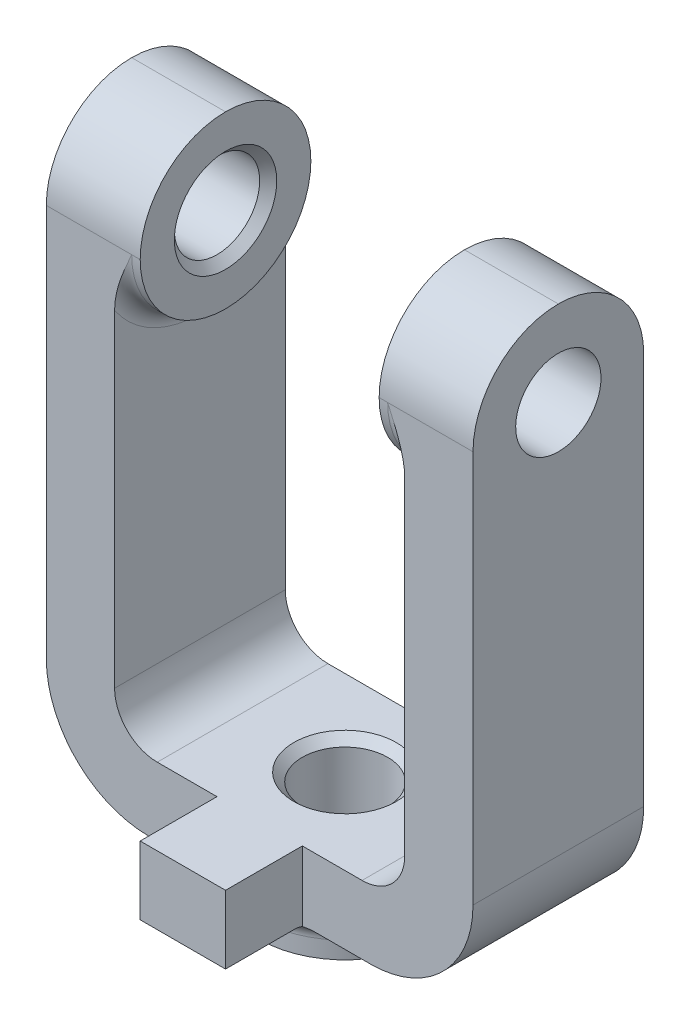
ISO-10303-21;
HEADER;
FILE_DESCRIPTION(('STEP AP214'),'2;1');
FILE_NAME('part.step','',(''),(''),'','','');
FILE_SCHEMA(('AUTOMOTIVE_DESIGN { 1 0 10303 214 1 1 1 1 }'));
ENDSEC;
DATA;
#1=APPLICATION_CONTEXT('core data for automotive mechanical design processes');
#2=APPLICATION_PROTOCOL_DEFINITION('international standard','automotive_design',2000,#1);
#3=PRODUCT_CONTEXT('',#1,'mechanical');
#4=PRODUCT('Part','Part','',(#3));
#5=PRODUCT_RELATED_PRODUCT_CATEGORY('part','',(#4));
#6=PRODUCT_DEFINITION_FORMATION('','',#4);
#7=PRODUCT_DEFINITION_CONTEXT('part definition',#1,'design');
#8=PRODUCT_DEFINITION('design','',#6,#7);
#9=PRODUCT_DEFINITION_SHAPE('','',#8);
#10=(LENGTH_UNIT() NAMED_UNIT(*) SI_UNIT(.MILLI.,.METRE.));
#11=(NAMED_UNIT(*) PLANE_ANGLE_UNIT() SI_UNIT($,.RADIAN.));
#12=(NAMED_UNIT(*) SI_UNIT($,.STERADIAN.) SOLID_ANGLE_UNIT());
#13=UNCERTAINTY_MEASURE_WITH_UNIT(LENGTH_MEASURE(1.E-05),#10,'distance_accuracy_value','');
#14=(GEOMETRIC_REPRESENTATION_CONTEXT(3) GLOBAL_UNCERTAINTY_ASSIGNED_CONTEXT((#13)) GLOBAL_UNIT_ASSIGNED_CONTEXT((#10,
#11,#12)) REPRESENTATION_CONTEXT('',''));
#15=CARTESIAN_POINT('',(0.,0.,0.));
#16=DIRECTION('',(0.,0.,1.));
#17=DIRECTION('',(1.,0.,0.));
#18=AXIS2_PLACEMENT_3D('',#15,#16,#17);
#19=CARTESIAN_POINT('',(8.00000000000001,-14.8023255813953,20.));
#20=DIRECTION('',(0.,1.,0.));
#21=DIRECTION('',(-1.,0.,0.));
#22=AXIS2_PLACEMENT_3D('',#19,#20,#21);
#23=PLANE('',#22);
#24=DIRECTION('',(1.,0.,0.));
#25=VECTOR('',#24,1.);
#26=CARTESIAN_POINT('',(-17.,-14.8023255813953,29.));
#27=LINE('',#26,#25);
#28=CARTESIAN_POINT('',(-22.,-14.8023255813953,29.));
#29=VERTEX_POINT('',#28);
#30=CARTESIAN_POINT('',(-12.,-14.8023255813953,29.));
#31=VERTEX_POINT('',#30);
#32=EDGE_CURVE('E249',#29,#31,#27,.T.);
#33=ORIENTED_EDGE('',*,*,#32,.F.);
#34=DIRECTION('',(0.,0.,-1.));
#35=VECTOR('',#34,1.);
#36=CARTESIAN_POINT('',(-22.,-14.8023255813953,29.));
#37=LINE('',#36,#35);
#38=CARTESIAN_POINT('',(-22.,-14.8023255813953,20.9087121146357));
#39=VERTEX_POINT('',#38);
#40=EDGE_CURVE('E253',#29,#39,#37,.T.);
#41=ORIENTED_EDGE('',*,*,#40,.T.);
#42=CARTESIAN_POINT('',(-17.,-14.8023255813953,10.));
#43=DIRECTION('',(0.,1.,0.));
#44=DIRECTION('',(-1.,0.,0.));
#45=AXIS2_PLACEMENT_3D('',#42,#43,#44);
#46=CIRCLE('',#45,12.);
#47=CARTESIAN_POINT('',(-12.,-14.8023255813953,20.9087121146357));
#48=VERTEX_POINT('',#47);
#49=EDGE_CURVE('E576',#39,#48,#46,.T.);
#50=ORIENTED_EDGE('',*,*,#49,.T.);
#51=DIRECTION('',(0.,0.,-1.));
#52=VECTOR('',#51,1.);
#53=CARTESIAN_POINT('',(-12.,-14.8023255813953,29.));
#54=LINE('',#53,#52);
#55=EDGE_CURVE('E255',#31,#48,#54,.T.);
#56=ORIENTED_EDGE('',*,*,#55,.F.);
#57=EDGE_LOOP('',(#33,#41,#50,#56));
#58=FACE_BOUND('',#57,.T.);
#59=ADVANCED_FACE('F41',(#58),#23,.F.);
#60=CARTESIAN_POINT('',(0.,0.,20.));
#61=DIRECTION('',(0.,0.,1.));
#62=DIRECTION('',(1.,0.,0.));
#63=AXIS2_PLACEMENT_3D('',#60,#61,#62);
#64=PLANE('',#63);
#65=DIRECTION('',(-1.,0.,0.));
#66=VECTOR('',#65,1.);
#67=CARTESIAN_POINT('',(-17.,-6.80232558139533,20.));
#68=LINE('',#67,#66);
#69=CARTESIAN_POINT('',(-5.,-6.80232558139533,20.));
#70=VERTEX_POINT('',#69);
#71=CARTESIAN_POINT('',(-12.,-6.80232558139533,20.));
#72=VERTEX_POINT('',#71);
#73=EDGE_CURVE('E664',#70,#72,#68,.T.);
#74=ORIENTED_EDGE('',*,*,#73,.T.);
#75=DIRECTION('',(0.,1.,0.));
#76=VECTOR('',#75,1.);
#77=CARTESIAN_POINT('',(-12.,-14.8023255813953,20.));
#78=LINE('',#77,#76);
#79=CARTESIAN_POINT('',(-12.,-14.9780017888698,20.));
#80=VERTEX_POINT('',#79);
#81=EDGE_CURVE('E65',#80,#72,#78,.T.);
#82=ORIENTED_EDGE('',*,*,#81,.F.);
#83=CARTESIAN_POINT('',(-12.,-14.9780017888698,20.));
#84=CARTESIAN_POINT('',(-11.8654769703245,-14.9509843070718,20.));
#85=CARTESIAN_POINT('',(-11.7304067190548,-14.9265367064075,20.));
#86=CARTESIAN_POINT('',(-11.4596639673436,-14.8835990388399,20.));
#87=CARTESIAN_POINT('',(-11.3239937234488,-14.8650946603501,20.));
#88=CARTESIAN_POINT('',(-11.0517912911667,-14.8347118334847,20.));
#89=CARTESIAN_POINT('',(-10.9152585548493,-14.8228381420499,20.));
#90=CARTESIAN_POINT('',(-10.641420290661,-14.8066474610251,20.));
#91=CARTESIAN_POINT('',(-10.5041136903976,-14.8023489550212,20.));
#92=CARTESIAN_POINT('',(-10.3667504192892,-14.8023255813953,20.));
#93=B_SPLINE_CURVE_WITH_KNOTS('',3,(#83,#84,#85,#86,#87,#88,#89,#90,#91,#92),.UNSPECIFIED.,.F.,
.F.,(4,2,2,2,4),(0.,0.411646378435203,0.822293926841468,1.2332357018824,1.64517880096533),.UNSPECIFIED.);
#94=CARTESIAN_POINT('',(-10.3667504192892,-14.8023255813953,20.));
#95=VERTEX_POINT('',#94);
#96=EDGE_CURVE('E469',#80,#95,#93,.T.);
#97=ORIENTED_EDGE('',*,*,#96,.T.);
#98=DIRECTION('',(1.,0.,0.));
#99=VECTOR('',#98,1.);
#100=CARTESIAN_POINT('',(8.00000000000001,-14.8023255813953,20.));
#101=LINE('',#100,#99);
#102=CARTESIAN_POINT('',(-3.99999999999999,-14.8023255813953,20.));
#103=VERTEX_POINT('',#102);
#104=EDGE_CURVE('E662',#95,#103,#101,.T.);
#105=ORIENTED_EDGE('',*,*,#104,.T.);
#106=CARTESIAN_POINT('',(-3.99999999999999,-2.80232558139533,20.));
#107=DIRECTION('',(0.,0.,1.));
#108=DIRECTION('',(1.,0.,0.));
#109=AXIS2_PLACEMENT_3D('',#106,#107,#108);
#110=CIRCLE('',#109,12.);
#111=CARTESIAN_POINT('',(8.00000000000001,-2.80232558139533,20.));
#112=VERTEX_POINT('',#111);
#113=EDGE_CURVE('E628',#103,#112,#110,.T.);
#114=ORIENTED_EDGE('',*,*,#113,.T.);
#115=DIRECTION('',(0.,1.,0.));
#116=VECTOR('',#115,1.);
#117=CARTESIAN_POINT('',(8.,53.1976744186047,20.));
#118=LINE('',#117,#116);
#119=CARTESIAN_POINT('',(8.,43.1976744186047,20.));
#120=VERTEX_POINT('',#119);
#121=EDGE_CURVE('E650',#112,#120,#118,.T.);
#122=ORIENTED_EDGE('',*,*,#121,.T.);
#123=DIRECTION('',(-1.,0.,0.));
#124=VECTOR('',#123,1.);
#125=CARTESIAN_POINT('',(-3.,43.1976744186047,20.));
#126=LINE('',#125,#124);
#127=CARTESIAN_POINT('',(-2.,43.1976744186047,20.));
#128=VERTEX_POINT('',#127);
#129=EDGE_CURVE('E619',#120,#128,#126,.T.);
#130=ORIENTED_EDGE('',*,*,#129,.T.);
#131=CARTESIAN_POINT('',(0.,36.5644248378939,20.));
#132=CARTESIAN_POINT('',(-1.61871456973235E-05,36.6877783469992,20.));
#133=CARTESIAN_POINT('',(-0.00348602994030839,36.811092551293,20.));
#134=CARTESIAN_POINT('',(-0.0166408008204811,37.0573224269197,20.));
#135=CARTESIAN_POINT('',(-0.0263220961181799,37.1802382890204,20.));
#136=CARTESIAN_POINT('',(-0.0511737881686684,37.4251475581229,20.));
#137=CARTESIAN_POINT('',(-0.0663284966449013,37.5471425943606,20.));
#138=CARTESIAN_POINT('',(-0.101553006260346,37.7904316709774,20.));
#139=CARTESIAN_POINT('',(-0.121623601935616,37.9117255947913,20.));
#140=CARTESIAN_POINT('',(-0.187910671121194,38.2716869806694,20.));
#141=CARTESIAN_POINT('',(-0.240507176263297,38.5091901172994,20.));
#142=CARTESIAN_POINT('',(-0.359398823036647,38.9808588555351,20.));
#143=CARTESIAN_POINT('',(-0.425705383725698,39.2150214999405,20.));
#144=CARTESIAN_POINT('',(-0.596074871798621,39.7673813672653,20.));
#145=CARTESIAN_POINT('',(-0.704961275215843,40.0840800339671,20.));
#146=CARTESIAN_POINT('',(-0.936956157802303,40.7120893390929,20.));
#147=CARTESIAN_POINT('',(-1.06006391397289,41.0234002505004,20.));
#148=CARTESIAN_POINT('',(-1.4436518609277,41.9534857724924,20.));
#149=CARTESIAN_POINT('',(-1.71775089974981,42.5665447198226,20.));
#150=CARTESIAN_POINT('',(-1.99455670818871,43.1855028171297,20.));
#151=CARTESIAN_POINT('',(-1.99727836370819,43.1915886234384,20.));
#152=CARTESIAN_POINT('',(-2.,43.1976744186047,20.));
#153=B_SPLINE_CURVE_WITH_KNOTS('',3,(#131,#132,#133,#134,#135,#136,#137,#138,#139,#140,#141,
#142,#143,#144,#145,#146,#147,#148,#149,#150,#151,#152),.UNSPECIFIED.,.F.,.F.,(4,2,2,2,2,2,2,2,
2,2,4),(0.,0.36995557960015,0.739694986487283,1.10838292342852,1.47713048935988,
2.20632836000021,2.93613604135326,3.94027670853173,4.94436634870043,6.95846403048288,
6.97846403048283),.UNSPECIFIED.);
#154=CARTESIAN_POINT('',(0.,36.5644248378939,20.));
#155=VERTEX_POINT('',#154);
#156=EDGE_CURVE('E566',#128,#155,#153,.F.);
#157=ORIENTED_EDGE('',*,*,#156,.T.);
#158=DIRECTION('',(0.,-1.,0.));
#159=VECTOR('',#158,1.);
#160=CARTESIAN_POINT('',(0.,-6.80232558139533,20.));
#161=LINE('',#160,#159);
#162=CARTESIAN_POINT('',(0.,-1.80232558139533,20.));
#163=VERTEX_POINT('',#162);
#164=EDGE_CURVE('E653',#155,#163,#161,.T.);
#165=ORIENTED_EDGE('',*,*,#164,.T.);
#166=CARTESIAN_POINT('',(-5.,-1.80232558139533,20.));
#167=DIRECTION('',(0.,0.,1.));
#168=DIRECTION('',(1.,0.,0.));
#169=AXIS2_PLACEMENT_3D('',#166,#167,#168);
#170=CIRCLE('',#169,5.);
#171=EDGE_CURVE('E639',#163,#70,#170,.F.);
#172=ORIENTED_EDGE('',*,*,#171,.T.);
#173=EDGE_LOOP('',(#74,#82,#97,#105,#114,#122,#130,#157,#165,#172));
#174=FACE_BOUND('',#173,.T.);
#175=ADVANCED_FACE('F457',(#174),#64,.T.);
#176=CARTESIAN_POINT('',(-17.,-6.80232558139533,20.));
#177=DIRECTION('',(0.,-1.,0.));
#178=DIRECTION('',(1.,0.,0.));
#179=AXIS2_PLACEMENT_3D('',#176,#177,#178);
#180=PLANE('',#179);
#181=CARTESIAN_POINT('',(-17.,-6.80232558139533,10.));
#182=DIRECTION('',(0.,-1.,0.));
#183=DIRECTION('',(1.,0.,0.));
#184=AXIS2_PLACEMENT_3D('',#181,#182,#183);
#185=CIRCLE('',#184,6.00000000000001);
#186=CARTESIAN_POINT('',(-11.,-6.80232558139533,10.));
#187=VERTEX_POINT('',#186);
#188=EDGE_CURVE('E501',#187,#187,#185,.T.);
#189=ORIENTED_EDGE('',*,*,#188,.T.);
#190=EDGE_LOOP('',(#189));
#191=FACE_BOUND('',#190,.T.);
#192=DIRECTION('',(-1.,0.,0.));
#193=VECTOR('',#192,1.);
#194=CARTESIAN_POINT('',(-17.,-6.80232558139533,0.));
#195=LINE('',#194,#193);
#196=CARTESIAN_POINT('',(-5.,-6.80232558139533,0.));
#197=VERTEX_POINT('',#196);
#198=CARTESIAN_POINT('',(-29.,-6.80232558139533,0.));
#199=VERTEX_POINT('',#198);
#200=EDGE_CURVE('E605',#197,#199,#195,.T.);
#201=ORIENTED_EDGE('',*,*,#200,.T.);
#202=DIRECTION('',(0.,0.,-1.));
#203=VECTOR('',#202,1.);
#204=CARTESIAN_POINT('',(-29.,-6.80232558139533,0.));
#205=LINE('',#204,#203);
#206=CARTESIAN_POINT('',(-29.,-6.80232558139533,20.));
#207=VERTEX_POINT('',#206);
#208=EDGE_CURVE('E294',#207,#199,#205,.T.);
#209=ORIENTED_EDGE('',*,*,#208,.F.);
#210=DIRECTION('',(1.,0.,0.));
#211=VECTOR('',#210,1.);
#212=CARTESIAN_POINT('',(-17.,-6.80232558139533,20.));
#213=LINE('',#212,#211);
#214=CARTESIAN_POINT('',(-22.,-6.80232558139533,20.));
#215=VERTEX_POINT('',#214);
#216=EDGE_CURVE('E284',#207,#215,#213,.T.);
#217=ORIENTED_EDGE('',*,*,#216,.T.);
#218=DIRECTION('',(0.,0.,-1.));
#219=VECTOR('',#218,1.);
#220=CARTESIAN_POINT('',(-22.,-6.80232558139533,29.));
#221=LINE('',#220,#219);
#222=CARTESIAN_POINT('',(-22.,-6.80232558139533,29.));
#223=VERTEX_POINT('',#222);
#224=EDGE_CURVE('E267',#223,#215,#221,.T.);
#225=ORIENTED_EDGE('',*,*,#224,.F.);
#226=DIRECTION('',(-1.,0.,0.));
#227=VECTOR('',#226,1.);
#228=CARTESIAN_POINT('',(-17.,-6.80232558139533,29.));
#229=LINE('',#228,#227);
#230=CARTESIAN_POINT('',(-12.,-6.80232558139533,29.));
#231=VERTEX_POINT('',#230);
#232=EDGE_CURVE('E264',#231,#223,#229,.T.);
#233=ORIENTED_EDGE('',*,*,#232,.F.);
#234=DIRECTION('',(0.,0.,-1.));
#235=VECTOR('',#234,1.);
#236=CARTESIAN_POINT('',(-12.,-6.80232558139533,29.));
#237=LINE('',#236,#235);
#238=EDGE_CURVE('E668',#231,#72,#237,.T.);
#239=ORIENTED_EDGE('',*,*,#238,.T.);
#240=ORIENTED_EDGE('',*,*,#73,.F.);
#241=DIRECTION('',(0.,0.,-1.));
#242=VECTOR('',#241,1.);
#243=CARTESIAN_POINT('',(-5.,-6.80232558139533,0.));
#244=LINE('',#243,#242);
#245=EDGE_CURVE('E647',#70,#197,#244,.T.);
#246=ORIENTED_EDGE('',*,*,#245,.T.);
#247=EDGE_LOOP('',(#201,#209,#217,#225,#233,#239,#240,#246));
#248=FACE_BOUND('',#247,.T.);
#249=ADVANCED_FACE('F529',(#191,#248),#180,.F.);
#250=CARTESIAN_POINT('',(-6.99999999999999,-18.8023255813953,20.));
#251=DIRECTION('',(0.,1.,0.));
#252=DIRECTION('',(0.,0.,1.));
#253=AXIS2_PLACEMENT_3D('',#250,#251,#252);
#254=PLANE('',#253);
#255=CARTESIAN_POINT('',(-17.,-18.8023255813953,10.));
#256=DIRECTION('',(0.,1.,0.));
#257=DIRECTION('',(0.,0.,1.));
#258=AXIS2_PLACEMENT_3D('',#255,#256,#257);
#259=CIRCLE('',#258,6.00000000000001);
#260=CARTESIAN_POINT('',(-17.,-18.8023255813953,16.));
#261=VERTEX_POINT('',#260);
#262=EDGE_CURVE('E11',#261,#261,#259,.T.);
#263=ORIENTED_EDGE('',*,*,#262,.T.);
#264=EDGE_LOOP('',(#263));
#265=FACE_BOUND('',#264,.T.);
#266=CARTESIAN_POINT('',(-17.,-18.8023255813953,10.));
#267=DIRECTION('',(0.,1.,0.));
#268=DIRECTION('',(0.,0.,1.));
#269=AXIS2_PLACEMENT_3D('',#266,#267,#268);
#270=CIRCLE('',#269,10.);
#271=CARTESIAN_POINT('',(-6.99999999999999,-18.8023255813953,10.));
#272=VERTEX_POINT('',#271);
#273=CARTESIAN_POINT('',(-27.,-18.8023255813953,10.));
#274=VERTEX_POINT('',#273);
#275=EDGE_CURVE('E624',#272,#274,#270,.F.);
#276=ORIENTED_EDGE('',*,*,#275,.T.);
#277=CARTESIAN_POINT('',(-17.,-18.8023255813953,10.));
#278=DIRECTION('',(0.,1.,0.));
#279=DIRECTION('',(0.,0.,1.));
#280=AXIS2_PLACEMENT_3D('',#277,#278,#279);
#281=CIRCLE('',#280,10.);
#282=EDGE_CURVE('E621',#274,#272,#281,.F.);
#283=ORIENTED_EDGE('',*,*,#282,.T.);
#284=EDGE_LOOP('',(#276,#283));
#285=FACE_BOUND('',#284,.T.);
#286=ADVANCED_FACE('F525',(#265,#285),#254,.F.);
#287=ORIENTED_EDGE('',*,*,#104,.F.);
#288=CARTESIAN_POINT('',(-17.,-14.8023255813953,10.));
#289=DIRECTION('',(0.,1.,0.));
#290=DIRECTION('',(-1.,0.,0.));
#291=AXIS2_PLACEMENT_3D('',#288,#289,#290);
#292=CIRCLE('',#291,12.);
#293=CARTESIAN_POINT('',(-4.99999999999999,-14.8023255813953,10.));
#294=VERTEX_POINT('',#293);
#295=EDGE_CURVE('E578',#95,#294,#292,.T.);
#296=ORIENTED_EDGE('',*,*,#295,.T.);
#297=CARTESIAN_POINT('',(-17.,-14.8023255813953,10.));
#298=DIRECTION('',(0.,1.,0.));
#299=DIRECTION('',(-1.,0.,0.));
#300=AXIS2_PLACEMENT_3D('',#297,#298,#299);
#301=CIRCLE('',#300,12.);
#302=CARTESIAN_POINT('',(-10.3667504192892,-14.8023255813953,0.));
#303=VERTEX_POINT('',#302);
#304=EDGE_CURVE('E580',#294,#303,#301,.T.);
#305=ORIENTED_EDGE('',*,*,#304,.T.);
#306=DIRECTION('',(1.,0.,0.));
#307=VECTOR('',#306,1.);
#308=CARTESIAN_POINT('',(8.00000000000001,-14.8023255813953,0.));
#309=LINE('',#308,#307);
#310=CARTESIAN_POINT('',(-3.99999999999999,-14.8023255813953,0.));
#311=VERTEX_POINT('',#310);
#312=EDGE_CURVE('E657',#303,#311,#309,.T.);
#313=ORIENTED_EDGE('',*,*,#312,.T.);
#314=DIRECTION('',(0.,0.,-1.));
#315=VECTOR('',#314,1.);
#316=CARTESIAN_POINT('',(-3.99999999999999,-14.8023255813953,20.));
#317=LINE('',#316,#315);
#318=EDGE_CURVE('E630',#311,#103,#317,.F.);
#319=ORIENTED_EDGE('',*,*,#318,.T.);
#320=EDGE_LOOP('',(#287,#296,#305,#313,#319));
#321=FACE_BOUND('',#320,.T.);
#322=ADVANCED_FACE('F521',(#321),#23,.F.);
#323=CARTESIAN_POINT('',(8.,53.1976744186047,20.));
#324=DIRECTION('',(-1.,0.,0.));
#325=DIRECTION('',(0.,-1.,0.));
#326=AXIS2_PLACEMENT_3D('',#323,#324,#325);
#327=PLANE('',#326);
#328=CARTESIAN_POINT('',(8.,43.1976744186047,10.));
#329=DIRECTION('',(-1.,0.,0.));
#330=DIRECTION('',(0.,-1.,0.));
#331=AXIS2_PLACEMENT_3D('',#328,#329,#330);
#332=CIRCLE('',#331,5.);
#333=CARTESIAN_POINT('',(8.,38.1976744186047,10.));
#334=VERTEX_POINT('',#333);
#335=EDGE_CURVE('E674',#334,#334,#332,.T.);
#336=ORIENTED_EDGE('',*,*,#335,.T.);
#337=EDGE_LOOP('',(#336));
#338=FACE_BOUND('',#337,.T.);
#339=DIRECTION('',(0.,1.,0.));
#340=VECTOR('',#339,1.);
#341=CARTESIAN_POINT('',(8.,53.1976744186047,0.));
#342=LINE('',#341,#340);
#343=CARTESIAN_POINT('',(8.00000000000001,-2.80232558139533,0.));
#344=VERTEX_POINT('',#343);
#345=CARTESIAN_POINT('',(8.,43.1976744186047,0.));
#346=VERTEX_POINT('',#345);
#347=EDGE_CURVE('E654',#344,#346,#342,.T.);
#348=ORIENTED_EDGE('',*,*,#347,.T.);
#349=CARTESIAN_POINT('',(8.,43.1976744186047,10.));
#350=DIRECTION('',(-1.,0.,0.));
#351=DIRECTION('',(0.,-1.,0.));
#352=AXIS2_PLACEMENT_3D('',#349,#350,#351);
#353=CIRCLE('',#352,10.);
#354=CARTESIAN_POINT('',(8.,53.1976744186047,10.));
#355=VERTEX_POINT('',#354);
#356=EDGE_CURVE('E592',#346,#355,#353,.F.);
#357=ORIENTED_EDGE('',*,*,#356,.T.);
#358=CARTESIAN_POINT('',(8.,43.1976744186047,10.));
#359=DIRECTION('',(-1.,0.,0.));
#360=DIRECTION('',(0.,-1.,0.));
#361=AXIS2_PLACEMENT_3D('',#358,#359,#360);
#362=CIRCLE('',#361,10.);
#363=EDGE_CURVE('E607',#355,#120,#362,.F.);
#364=ORIENTED_EDGE('',*,*,#363,.T.);
#365=ORIENTED_EDGE('',*,*,#121,.F.);
#366=DIRECTION('',(0.,0.,-1.));
#367=VECTOR('',#366,1.);
#368=CARTESIAN_POINT('',(8.00000000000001,-2.80232558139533,20.));
#369=LINE('',#368,#367);
#370=EDGE_CURVE('E636',#112,#344,#369,.T.);
#371=ORIENTED_EDGE('',*,*,#370,.T.);
#372=EDGE_LOOP('',(#348,#357,#364,#365,#371));
#373=FACE_BOUND('',#372,.T.);
#374=ADVANCED_FACE('F517',(#338,#373),#327,.F.);
#375=CARTESIAN_POINT('',(-3.,33.1976744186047,20.));
#376=DIRECTION('',(1.,0.,0.));
#377=DIRECTION('',(0.,0.,-1.));
#378=AXIS2_PLACEMENT_3D('',#375,#376,#377);
#379=PLANE('',#378);
#380=CARTESIAN_POINT('',(-3.,43.1976744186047,10.));
#381=DIRECTION('',(1.,0.,0.));
#382=DIRECTION('',(0.,0.,-1.));
#383=AXIS2_PLACEMENT_3D('',#380,#381,#382);
#384=CIRCLE('',#383,6.00000000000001);
#385=CARTESIAN_POINT('',(-3.,43.1976744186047,3.99999999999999));
#386=VERTEX_POINT('',#385);
#387=EDGE_CURVE('E50',#386,#386,#384,.T.);
#388=ORIENTED_EDGE('',*,*,#387,.T.);
#389=EDGE_LOOP('',(#388));
#390=FACE_BOUND('',#389,.T.);
#391=CARTESIAN_POINT('',(-3.,43.1976744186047,10.));
#392=DIRECTION('',(1.,0.,0.));
#393=DIRECTION('',(0.,0.,-1.));
#394=AXIS2_PLACEMENT_3D('',#391,#392,#393);
#395=CIRCLE('',#394,10.);
#396=CARTESIAN_POINT('',(-3.,53.1976744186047,10.));
#397=VERTEX_POINT('',#396);
#398=CARTESIAN_POINT('',(-3.,43.1976744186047,0.));
#399=VERTEX_POINT('',#398);
#400=EDGE_CURVE('E615',#397,#399,#395,.F.);
#401=ORIENTED_EDGE('',*,*,#400,.T.);
#402=CARTESIAN_POINT('',(-3.,43.1976744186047,10.));
#403=DIRECTION('',(1.,0.,0.));
#404=DIRECTION('',(0.,0.,-1.));
#405=AXIS2_PLACEMENT_3D('',#402,#403,#404);
#406=CIRCLE('',#405,10.);
#407=CARTESIAN_POINT('',(-3.,33.1976744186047,10.));
#408=VERTEX_POINT('',#407);
#409=EDGE_CURVE('E609',#399,#408,#406,.F.);
#410=ORIENTED_EDGE('',*,*,#409,.T.);
#411=CARTESIAN_POINT('',(-3.,43.1976744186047,10.));
#412=DIRECTION('',(1.,0.,0.));
#413=DIRECTION('',(0.,0.,-1.));
#414=AXIS2_PLACEMENT_3D('',#411,#412,#413);
#415=CIRCLE('',#414,10.);
#416=CARTESIAN_POINT('',(-3.,43.1976744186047,20.));
#417=VERTEX_POINT('',#416);
#418=EDGE_CURVE('E612',#408,#417,#415,.F.);
#419=ORIENTED_EDGE('',*,*,#418,.T.);
#420=CARTESIAN_POINT('',(-3.,43.1976744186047,10.));
#421=DIRECTION('',(1.,0.,0.));
#422=DIRECTION('',(0.,0.,-1.));
#423=AXIS2_PLACEMENT_3D('',#420,#421,#422);
#424=CIRCLE('',#423,10.);
#425=EDGE_CURVE('E617',#417,#397,#424,.F.);
#426=ORIENTED_EDGE('',*,*,#425,.T.);
#427=EDGE_LOOP('',(#401,#410,#419,#426));
#428=FACE_BOUND('',#427,.T.);
#429=ADVANCED_FACE('F513',(#390,#428),#379,.F.);
#430=CARTESIAN_POINT('',(0.,0.,20.));
#431=DIRECTION('',(1.,0.,0.));
#432=DIRECTION('',(0.,0.,-1.));
#433=AXIS2_PLACEMENT_3D('',#430,#431,#432);
#434=PLANE('',#433);
#435=ORIENTED_EDGE('',*,*,#164,.F.);
#436=CARTESIAN_POINT('',(0.,43.1976744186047,10.));
#437=DIRECTION('',(1.,0.,0.));
#438=DIRECTION('',(0.,0.,-1.));
#439=AXIS2_PLACEMENT_3D('',#436,#437,#438);
#440=CIRCLE('',#439,12.);
#441=CARTESIAN_POINT('',(0.,31.1976744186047,10.));
#442=VERTEX_POINT('',#441);
#443=EDGE_CURVE('E587',#155,#442,#440,.T.);
#444=ORIENTED_EDGE('',*,*,#443,.T.);
#445=CARTESIAN_POINT('',(0.,43.1976744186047,10.));
#446=DIRECTION('',(1.,0.,0.));
#447=DIRECTION('',(0.,0.,-1.));
#448=AXIS2_PLACEMENT_3D('',#445,#446,#447);
#449=CIRCLE('',#448,12.);
#450=CARTESIAN_POINT('',(0.,36.5644248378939,0.));
#451=VERTEX_POINT('',#450);
#452=EDGE_CURVE('E590',#442,#451,#449,.T.);
#453=ORIENTED_EDGE('',*,*,#452,.T.);
#454=DIRECTION('',(0.,-1.,0.));
#455=VECTOR('',#454,1.);
#456=CARTESIAN_POINT('',(0.,0.,0.));
#457=LINE('',#456,#455);
#458=CARTESIAN_POINT('',(0.,-1.80232558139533,0.));
#459=VERTEX_POINT('',#458);
#460=EDGE_CURVE('E651',#451,#459,#457,.T.);
#461=ORIENTED_EDGE('',*,*,#460,.T.);
#462=DIRECTION('',(0.,0.,-1.));
#463=VECTOR('',#462,1.);
#464=CARTESIAN_POINT('',(0.,-1.80232558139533,20.));
#465=LINE('',#464,#463);
#466=EDGE_CURVE('E644',#459,#163,#465,.F.);
#467=ORIENTED_EDGE('',*,*,#466,.T.);
#468=EDGE_LOOP('',(#435,#444,#453,#461,#467));
#469=FACE_BOUND('',#468,.T.);
#470=ADVANCED_FACE('F509',(#469),#434,.F.);
#471=CARTESIAN_POINT('',(0.,0.,0.));
#472=DIRECTION('',(0.,0.,1.));
#473=DIRECTION('',(1.,0.,0.));
#474=AXIS2_PLACEMENT_3D('',#471,#472,#473);
#475=PLANE('',#474);
#476=ORIENTED_EDGE('',*,*,#312,.F.);
#477=CARTESIAN_POINT('',(-10.3667504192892,-14.8023255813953,0.));
#478=CARTESIAN_POINT('',(-10.4901039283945,-14.802341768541,0.));
#479=CARTESIAN_POINT('',(-10.6134181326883,-14.8058116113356,0.));
#480=CARTESIAN_POINT('',(-10.859648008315,-14.8189663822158,0.));
#481=CARTESIAN_POINT('',(-10.9825638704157,-14.8286476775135,0.));
#482=CARTESIAN_POINT('',(-11.2274731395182,-14.853499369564,0.));
#483=CARTESIAN_POINT('',(-11.3494681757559,-14.8686540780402,0.));
#484=CARTESIAN_POINT('',(-11.5927572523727,-14.9038785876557,0.));
#485=CARTESIAN_POINT('',(-11.7140511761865,-14.9239491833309,0.));
#486=CARTESIAN_POINT('',(-12.0740125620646,-14.9902362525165,0.));
#487=CARTESIAN_POINT('',(-12.3115156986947,-15.0428327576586,0.));
#488=CARTESIAN_POINT('',(-12.7831844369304,-15.161724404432,0.));
#489=CARTESIAN_POINT('',(-13.0173470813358,-15.228030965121,0.));
#490=CARTESIAN_POINT('',(-13.5697069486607,-15.3984004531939,0.));
#491=CARTESIAN_POINT('',(-13.8864056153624,-15.5072868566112,0.));
#492=CARTESIAN_POINT('',(-14.5144149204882,-15.7392817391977,0.));
#493=CARTESIAN_POINT('',(-14.8257258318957,-15.8623894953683,0.));
#494=CARTESIAN_POINT('',(-15.7558113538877,-16.2459774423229,0.));
#495=CARTESIAN_POINT('',(-16.3688703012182,-16.5200764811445,0.));
#496=CARTESIAN_POINT('',(-16.987828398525,-16.796882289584,0.));
#497=CARTESIAN_POINT('',(-16.9939142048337,-16.7996039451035,0.));
#498=CARTESIAN_POINT('',(-17.,-16.8023255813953,0.));
#499=B_SPLINE_CURVE_WITH_KNOTS('',3,(#477,#478,#479,#480,#481,#482,#483,#484,#485,#486,#487,
#488,#489,#490,#491,#492,#493,#494,#495,#496,#497,#498),.UNSPECIFIED.,.F.,.F.,(4,2,2,2,2,2,2,2,
2,2,4),(0.,0.369955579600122,0.739694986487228,1.10838292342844,1.47713048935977,
2.20632836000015,2.93613604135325,3.94027670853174,4.94436634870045,6.95846403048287,
6.97846403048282),.UNSPECIFIED.);
#500=CARTESIAN_POINT('',(-17.,-16.8023255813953,0.));
#501=VERTEX_POINT('',#500);
#502=EDGE_CURVE('E57',#303,#501,#499,.T.);
#503=ORIENTED_EDGE('',*,*,#502,.T.);
#504=CARTESIAN_POINT('',(-23.6332495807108,-14.8023255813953,0.));
#505=CARTESIAN_POINT('',(-23.5098960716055,-14.802341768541,0.));
#506=CARTESIAN_POINT('',(-23.3865818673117,-14.8058116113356,0.));
#507=CARTESIAN_POINT('',(-23.140351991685,-14.8189663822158,0.));
#508=CARTESIAN_POINT('',(-23.0174361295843,-14.8286476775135,0.));
#509=CARTESIAN_POINT('',(-22.7725268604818,-14.853499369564,0.));
#510=CARTESIAN_POINT('',(-22.6505318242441,-14.8686540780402,0.));
#511=CARTESIAN_POINT('',(-22.4072427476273,-14.9038785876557,0.));
#512=CARTESIAN_POINT('',(-22.2859488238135,-14.9239491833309,0.));
#513=CARTESIAN_POINT('',(-21.9259874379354,-14.9902362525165,0.));
#514=CARTESIAN_POINT('',(-21.6884843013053,-15.0428327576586,0.));
#515=CARTESIAN_POINT('',(-21.2168155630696,-15.161724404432,0.));
#516=CARTESIAN_POINT('',(-20.9826529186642,-15.228030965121,0.));
#517=CARTESIAN_POINT('',(-20.4302930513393,-15.3984004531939,0.));
#518=CARTESIAN_POINT('',(-20.1135943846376,-15.5072868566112,0.));
#519=CARTESIAN_POINT('',(-19.4855850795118,-15.7392817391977,0.));
#520=CARTESIAN_POINT('',(-19.1742741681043,-15.8623894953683,0.));
#521=CARTESIAN_POINT('',(-18.2441886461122,-16.2459774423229,0.));
#522=CARTESIAN_POINT('',(-17.6311296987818,-16.5200764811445,0.));
#523=CARTESIAN_POINT('',(-17.012171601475,-16.796882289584,0.));
#524=CARTESIAN_POINT('',(-17.0060857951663,-16.7996039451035,0.));
#525=CARTESIAN_POINT('',(-17.,-16.8023255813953,0.));
#526=B_SPLINE_CURVE_WITH_KNOTS('',3,(#504,#505,#506,#507,#508,#509,#510,#511,#512,#513,#514,
#515,#516,#517,#518,#519,#520,#521,#522,#523,#524,#525),.UNSPECIFIED.,.F.,.F.,(4,2,2,2,2,2,2,2,
2,2,4),(0.,0.369955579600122,0.739694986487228,1.10838292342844,1.47713048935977,
2.20632836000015,2.93613604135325,3.94027670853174,4.94436634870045,6.95846403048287,
6.97846403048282),.UNSPECIFIED.);
#527=CARTESIAN_POINT('',(-23.6332495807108,-14.8023255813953,0.));
#528=VERTEX_POINT('',#527);
#529=EDGE_CURVE('E413',#528,#501,#526,.T.);
#530=ORIENTED_EDGE('',*,*,#529,.F.);
#531=DIRECTION('',(-1.,0.,0.));
#532=VECTOR('',#531,1.);
#533=CARTESIAN_POINT('',(-42.,-14.8023255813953,0.));
#534=LINE('',#533,#532);
#535=CARTESIAN_POINT('',(-30.,-14.8023255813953,0.));
#536=VERTEX_POINT('',#535);
#537=EDGE_CURVE('E295',#528,#536,#534,.T.);
#538=ORIENTED_EDGE('',*,*,#537,.T.);
#539=CARTESIAN_POINT('',(-30.,-2.80232558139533,0.));
#540=DIRECTION('',(0.,0.,-1.));
#541=DIRECTION('',(-1.,0.,0.));
#542=AXIS2_PLACEMENT_3D('',#539,#540,#541);
#543=CIRCLE('',#542,12.);
#544=CARTESIAN_POINT('',(-42.,-2.80232558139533,0.));
#545=VERTEX_POINT('',#544);
#546=EDGE_CURVE('E316',#545,#536,#543,.F.);
#547=ORIENTED_EDGE('',*,*,#546,.F.);
#548=DIRECTION('',(0.,1.,0.));
#549=VECTOR('',#548,1.);
#550=CARTESIAN_POINT('',(-42.,53.1976744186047,0.));
#551=LINE('',#550,#549);
#552=CARTESIAN_POINT('',(-42.,43.1976744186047,0.));
#553=VERTEX_POINT('',#552);
#554=EDGE_CURVE('E298',#545,#553,#551,.T.);
#555=ORIENTED_EDGE('',*,*,#554,.T.);
#556=DIRECTION('',(1.,0.,0.));
#557=VECTOR('',#556,1.);
#558=CARTESIAN_POINT('',(-34.,43.1976744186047,0.));
#559=LINE('',#558,#557);
#560=CARTESIAN_POINT('',(-32.,43.1976744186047,0.));
#561=VERTEX_POINT('',#560);
#562=EDGE_CURVE('E323',#561,#553,#559,.F.);
#563=ORIENTED_EDGE('',*,*,#562,.F.);
#564=CARTESIAN_POINT('',(-34.,36.5644248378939,0.));
#565=CARTESIAN_POINT('',(-33.9999838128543,36.6877783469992,0.));
#566=CARTESIAN_POINT('',(-33.9965139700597,36.811092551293,0.));
#567=CARTESIAN_POINT('',(-33.9833591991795,37.0573224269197,0.));
#568=CARTESIAN_POINT('',(-33.9736779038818,37.1802382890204,0.));
#569=CARTESIAN_POINT('',(-33.9488262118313,37.4251475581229,0.));
#570=CARTESIAN_POINT('',(-33.9336715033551,37.5471425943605,0.));
#571=CARTESIAN_POINT('',(-33.8984469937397,37.7904316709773,0.));
#572=CARTESIAN_POINT('',(-33.8783763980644,37.9117255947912,0.));
#573=CARTESIAN_POINT('',(-33.8120893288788,38.2716869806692,0.));
#574=CARTESIAN_POINT('',(-33.7594928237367,38.5091901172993,0.));
#575=CARTESIAN_POINT('',(-33.6406011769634,38.9808588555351,0.));
#576=CARTESIAN_POINT('',(-33.5742946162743,39.2150214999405,0.));
#577=CARTESIAN_POINT('',(-33.4039251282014,39.7673813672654,0.));
#578=CARTESIAN_POINT('',(-33.2950387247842,40.0840800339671,0.));
#579=CARTESIAN_POINT('',(-33.0630438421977,40.7120893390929,0.));
#580=CARTESIAN_POINT('',(-32.939936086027,41.0234002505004,0.));
#581=CARTESIAN_POINT('',(-32.5563481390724,41.9534857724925,0.));
#582=CARTESIAN_POINT('',(-32.2822491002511,42.566544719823,0.));
#583=CARTESIAN_POINT('',(-32.0054432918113,43.1855028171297,0.));
#584=CARTESIAN_POINT('',(-32.0027216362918,43.1915886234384,0.));
#585=CARTESIAN_POINT('',(-32.,43.1976744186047,0.));
#586=B_SPLINE_CURVE_WITH_KNOTS('',3,(#564,#565,#566,#567,#568,#569,#570,#571,#572,#573,#574,
#575,#576,#577,#578,#579,#580,#581,#582,#583,#584,#585),.UNSPECIFIED.,.F.,.F.,(4,2,2,2,2,2,2,2,
2,2,4),(0.,0.369955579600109,0.739694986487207,1.10838292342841,1.47713048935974,
2.20632836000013,2.93613604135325,3.94027670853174,4.94436634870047,6.95846403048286,
6.97846403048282),.UNSPECIFIED.);
#587=CARTESIAN_POINT('',(-34.,36.5644248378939,0.));
#588=VERTEX_POINT('',#587);
#589=EDGE_CURVE('E382',#588,#561,#586,.T.);
#590=ORIENTED_EDGE('',*,*,#589,.F.);
#591=DIRECTION('',(0.,-1.,0.));
#592=VECTOR('',#591,1.);
#593=CARTESIAN_POINT('',(-34.,0.,0.));
#594=LINE('',#593,#592);
#595=CARTESIAN_POINT('',(-34.,-1.80232558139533,0.));
#596=VERTEX_POINT('',#595);
#597=EDGE_CURVE('E285',#588,#596,#594,.T.);
#598=ORIENTED_EDGE('',*,*,#597,.T.);
#599=CARTESIAN_POINT('',(-29.,-1.80232558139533,0.));
#600=DIRECTION('',(0.,0.,-1.));
#601=DIRECTION('',(-1.,0.,0.));
#602=AXIS2_PLACEMENT_3D('',#599,#600,#601);
#603=CIRCLE('',#602,5.);
#604=EDGE_CURVE('E308',#199,#596,#603,.T.);
#605=ORIENTED_EDGE('',*,*,#604,.F.);
#606=ORIENTED_EDGE('',*,*,#200,.F.);
#607=CARTESIAN_POINT('',(-5.,-1.80232558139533,0.));
#608=DIRECTION('',(0.,0.,1.));
#609=DIRECTION('',(1.,0.,0.));
#610=AXIS2_PLACEMENT_3D('',#607,#608,#609);
#611=CIRCLE('',#610,5.);
#612=EDGE_CURVE('E641',#197,#459,#611,.T.);
#613=ORIENTED_EDGE('',*,*,#612,.T.);
#614=ORIENTED_EDGE('',*,*,#460,.F.);
#615=CARTESIAN_POINT('',(0.,36.5644248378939,0.));
#616=CARTESIAN_POINT('',(-1.61871456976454E-05,36.6877783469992,0.));
#617=CARTESIAN_POINT('',(-0.00348602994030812,36.811092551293,0.));
#618=CARTESIAN_POINT('',(-0.0166408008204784,37.0573224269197,0.));
#619=CARTESIAN_POINT('',(-0.0263220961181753,37.1802382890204,0.));
#620=CARTESIAN_POINT('',(-0.0511737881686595,37.4251475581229,0.));
#621=CARTESIAN_POINT('',(-0.0663284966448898,37.5471425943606,0.));
#622=CARTESIAN_POINT('',(-0.101553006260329,37.7904316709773,0.));
#623=CARTESIAN_POINT('',(-0.121623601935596,37.9117255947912,0.));
#624=CARTESIAN_POINT('',(-0.187910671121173,38.2716869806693,0.));
#625=CARTESIAN_POINT('',(-0.240507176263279,38.5091901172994,0.));
#626=CARTESIAN_POINT('',(-0.359398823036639,38.9808588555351,0.));
#627=CARTESIAN_POINT('',(-0.425705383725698,39.2150214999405,0.));
#628=CARTESIAN_POINT('',(-0.596074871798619,39.7673813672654,0.));
#629=CARTESIAN_POINT('',(-0.704961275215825,40.0840800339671,0.));
#630=CARTESIAN_POINT('',(-0.936956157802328,40.7120893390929,0.));
#631=CARTESIAN_POINT('',(-1.06006391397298,41.0234002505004,0.));
#632=CARTESIAN_POINT('',(-1.44365186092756,41.9534857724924,0.));
#633=CARTESIAN_POINT('',(-1.717750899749,42.566544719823,0.));
#634=CARTESIAN_POINT('',(-1.9945567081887,43.1855028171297,0.));
#635=CARTESIAN_POINT('',(-1.99727836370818,43.1915886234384,0.));
#636=CARTESIAN_POINT('',(-2.,43.1976744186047,0.));
#637=B_SPLINE_CURVE_WITH_KNOTS('',3,(#615,#616,#617,#618,#619,#620,#621,#622,#623,#624,#625,
#626,#627,#628,#629,#630,#631,#632,#633,#634,#635,#636),.UNSPECIFIED.,.F.,.F.,(4,2,2,2,2,2,2,2,
2,2,4),(0.,0.369955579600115,0.739694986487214,1.10838292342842,1.47713048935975,
2.20632836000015,2.93613604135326,3.94027670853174,4.94436634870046,6.95846403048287,
6.97846403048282),.UNSPECIFIED.);
#638=CARTESIAN_POINT('',(-2.,43.1976744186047,0.));
#639=VERTEX_POINT('',#638);
#640=EDGE_CURVE('E470',#451,#639,#637,.T.);
#641=ORIENTED_EDGE('',*,*,#640,.T.);
#642=DIRECTION('',(-1.,0.,0.));
#643=VECTOR('',#642,1.);
#644=CARTESIAN_POINT('',(0.,43.1976744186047,0.));
#645=LINE('',#644,#643);
#646=EDGE_CURVE('E626',#639,#346,#645,.F.);
#647=ORIENTED_EDGE('',*,*,#646,.T.);
#648=ORIENTED_EDGE('',*,*,#347,.F.);
#649=CARTESIAN_POINT('',(-3.99999999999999,-2.80232558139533,0.));
#650=DIRECTION('',(0.,0.,1.));
#651=DIRECTION('',(1.,0.,0.));
#652=AXIS2_PLACEMENT_3D('',#649,#650,#651);
#653=CIRCLE('',#652,12.);
#654=EDGE_CURVE('E633',#344,#311,#653,.F.);
#655=ORIENTED_EDGE('',*,*,#654,.T.);
#656=EDGE_LOOP('',(#476,#503,#530,#538,#547,#555,#563,#590,#598,#605,#606,#613,#614,#641,#647,
#648,#655));
#657=FACE_BOUND('',#656,.T.);
#658=ADVANCED_FACE('F504',(#657),#475,.F.);
#659=CARTESIAN_POINT('',(-5.,-1.80232558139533,20.));
#660=DIRECTION('',(0.,0.,1.));
#661=DIRECTION('',(1.,0.,0.));
#662=AXIS2_PLACEMENT_3D('',#659,#660,#661);
#663=CYLINDRICAL_SURFACE('',#662,5.);
#664=ORIENTED_EDGE('',*,*,#171,.F.);
#665=ORIENTED_EDGE('',*,*,#466,.F.);
#666=ORIENTED_EDGE('',*,*,#612,.F.);
#667=ORIENTED_EDGE('',*,*,#245,.F.);
#668=EDGE_LOOP('',(#664,#665,#666,#667));
#669=FACE_BOUND('',#668,.T.);
#670=ADVANCED_FACE('F508',(#669),#663,.F.);
#671=CARTESIAN_POINT('',(-3.99999999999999,-2.80232558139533,20.));
#672=DIRECTION('',(0.,0.,-1.));
#673=DIRECTION('',(-1.,0.,0.));
#674=AXIS2_PLACEMENT_3D('',#671,#672,#673);
#675=CYLINDRICAL_SURFACE('',#674,12.);
#676=ORIENTED_EDGE('',*,*,#113,.F.);
#677=ORIENTED_EDGE('',*,*,#318,.F.);
#678=ORIENTED_EDGE('',*,*,#654,.F.);
#679=ORIENTED_EDGE('',*,*,#370,.F.);
#680=EDGE_LOOP('',(#676,#677,#678,#679));
#681=FACE_BOUND('',#680,.T.);
#682=ADVANCED_FACE('F536',(#681),#675,.T.);
#683=CARTESIAN_POINT('',(-17.,0.,10.));
#684=DIRECTION('',(0.,-1.,0.));
#685=DIRECTION('',(1.,0.,0.));
#686=AXIS2_PLACEMENT_3D('',#683,#684,#685);
#687=CYLINDRICAL_SURFACE('',#686,10.);
#688=DIRECTION('',(0.,1.,0.));
#689=VECTOR('',#688,1.);
#690=CARTESIAN_POINT('',(-6.99999999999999,-18.8023255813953,10.));
#691=LINE('',#690,#689);
#692=CARTESIAN_POINT('',(-6.99999999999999,-16.8023255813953,10.));
#693=VERTEX_POINT('',#692);
#694=EDGE_CURVE('E596',#693,#272,#691,.F.);
#695=ORIENTED_EDGE('',*,*,#694,.F.);
#696=CARTESIAN_POINT('',(-17.,-16.8023255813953,10.));
#697=DIRECTION('',(0.,1.,0.));
#698=DIRECTION('',(-1.,0.,0.));
#699=AXIS2_PLACEMENT_3D('',#696,#697,#698);
#700=CIRCLE('',#699,10.);
#701=CARTESIAN_POINT('',(-27.,-16.8023255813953,10.));
#702=VERTEX_POINT('',#701);
#703=EDGE_CURVE('E574',#693,#702,#700,.F.);
#704=ORIENTED_EDGE('',*,*,#703,.T.);
#705=DIRECTION('',(0.,1.,0.));
#706=VECTOR('',#705,1.);
#707=CARTESIAN_POINT('',(-27.,-18.8023255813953,10.));
#708=LINE('',#707,#706);
#709=EDGE_CURVE('E299',#702,#274,#708,.F.);
#710=ORIENTED_EDGE('',*,*,#709,.T.);
#711=ORIENTED_EDGE('',*,*,#275,.F.);
#712=EDGE_LOOP('',(#695,#704,#710,#711));
#713=FACE_BOUND('',#712,.T.);
#714=ADVANCED_FACE('F540',(#713),#687,.T.);
#715=CARTESIAN_POINT('',(-17.,-14.8023255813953,10.));
#716=DIRECTION('',(0.,1.,0.));
#717=DIRECTION('',(-1.,0.,0.));
#718=AXIS2_PLACEMENT_3D('',#715,#716,#717);
#719=CYLINDRICAL_SURFACE('',#718,10.);
#720=ORIENTED_EDGE('',*,*,#282,.F.);
#721=ORIENTED_EDGE('',*,*,#709,.F.);
#722=CARTESIAN_POINT('',(-17.,-16.8023255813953,10.));
#723=DIRECTION('',(0.,-1.,0.));
#724=DIRECTION('',(1.,0.,0.));
#725=AXIS2_PLACEMENT_3D('',#722,#723,#724);
#726=CIRCLE('',#725,10.);
#727=EDGE_CURVE('E370',#501,#702,#726,.F.);
#728=ORIENTED_EDGE('',*,*,#727,.F.);
#729=CARTESIAN_POINT('',(-17.,-16.8023255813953,10.));
#730=DIRECTION('',(0.,1.,0.));
#731=DIRECTION('',(-1.,0.,0.));
#732=AXIS2_PLACEMENT_3D('',#729,#730,#731);
#733=CIRCLE('',#732,10.);
#734=EDGE_CURVE('E572',#501,#693,#733,.F.);
#735=ORIENTED_EDGE('',*,*,#734,.T.);
#736=ORIENTED_EDGE('',*,*,#694,.T.);
#737=EDGE_LOOP('',(#720,#721,#728,#735,#736));
#738=FACE_BOUND('',#737,.T.);
#739=ADVANCED_FACE('F542',(#738),#719,.T.);
#740=CARTESIAN_POINT('',(0.,43.1976744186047,10.));
#741=DIRECTION('',(1.,0.,0.));
#742=DIRECTION('',(0.,0.,-1.));
#743=AXIS2_PLACEMENT_3D('',#740,#741,#742);
#744=CYLINDRICAL_SURFACE('',#743,10.);
#745=ORIENTED_EDGE('',*,*,#129,.F.);
#746=ORIENTED_EDGE('',*,*,#363,.F.);
#747=DIRECTION('',(-1.,0.,0.));
#748=VECTOR('',#747,1.);
#749=CARTESIAN_POINT('',(8.,53.1976744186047,10.));
#750=LINE('',#749,#748);
#751=EDGE_CURVE('E593',#397,#355,#750,.F.);
#752=ORIENTED_EDGE('',*,*,#751,.F.);
#753=ORIENTED_EDGE('',*,*,#425,.F.);
#754=DIRECTION('',(-1.,0.,0.));
#755=VECTOR('',#754,1.);
#756=CARTESIAN_POINT('',(-3.,43.1976744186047,20.));
#757=LINE('',#756,#755);
#758=EDGE_CURVE('E597',#128,#417,#757,.T.);
#759=ORIENTED_EDGE('',*,*,#758,.F.);
#760=EDGE_LOOP('',(#745,#746,#752,#753,#759));
#761=FACE_BOUND('',#760,.T.);
#762=ADVANCED_FACE('F545',(#761),#744,.T.);
#763=CARTESIAN_POINT('',(-3.,43.1976744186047,10.));
#764=DIRECTION('',(-1.,0.,0.));
#765=DIRECTION('',(0.,0.,1.));
#766=AXIS2_PLACEMENT_3D('',#763,#764,#765);
#767=CYLINDRICAL_SURFACE('',#766,10.);
#768=ORIENTED_EDGE('',*,*,#356,.F.);
#769=ORIENTED_EDGE('',*,*,#646,.F.);
#770=DIRECTION('',(-1.,0.,0.));
#771=VECTOR('',#770,1.);
#772=CARTESIAN_POINT('',(0.,43.1976744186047,0.));
#773=LINE('',#772,#771);
#774=EDGE_CURVE('E599',#399,#639,#773,.F.);
#775=ORIENTED_EDGE('',*,*,#774,.F.);
#776=ORIENTED_EDGE('',*,*,#400,.F.);
#777=ORIENTED_EDGE('',*,*,#751,.T.);
#778=EDGE_LOOP('',(#768,#769,#775,#776,#777));
#779=FACE_BOUND('',#778,.T.);
#780=ADVANCED_FACE('F556',(#779),#767,.T.);
#781=CARTESIAN_POINT('',(0.,43.1976744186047,10.));
#782=DIRECTION('',(-1.,0.,0.));
#783=DIRECTION('',(0.,0.,1.));
#784=AXIS2_PLACEMENT_3D('',#781,#782,#783);
#785=CYLINDRICAL_SURFACE('',#784,10.);
#786=DIRECTION('',(1.,0.,0.));
#787=VECTOR('',#786,1.);
#788=CARTESIAN_POINT('',(-3.,33.1976744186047,10.));
#789=LINE('',#788,#787);
#790=CARTESIAN_POINT('',(-2.,33.1976744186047,10.));
#791=VERTEX_POINT('',#790);
#792=EDGE_CURVE('E602',#791,#408,#789,.F.);
#793=ORIENTED_EDGE('',*,*,#792,.F.);
#794=CARTESIAN_POINT('',(-2.,43.1976744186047,10.));
#795=DIRECTION('',(1.,0.,0.));
#796=DIRECTION('',(0.,0.,-1.));
#797=AXIS2_PLACEMENT_3D('',#794,#795,#796);
#798=CIRCLE('',#797,10.);
#799=EDGE_CURVE('E584',#791,#128,#798,.F.);
#800=ORIENTED_EDGE('',*,*,#799,.T.);
#801=ORIENTED_EDGE('',*,*,#758,.T.);
#802=ORIENTED_EDGE('',*,*,#418,.F.);
#803=EDGE_LOOP('',(#793,#800,#801,#802));
#804=FACE_BOUND('',#803,.T.);
#805=ADVANCED_FACE('F552',(#804),#785,.T.);
#806=CARTESIAN_POINT('',(0.,43.1976744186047,10.));
#807=DIRECTION('',(1.,0.,0.));
#808=DIRECTION('',(0.,0.,-1.));
#809=AXIS2_PLACEMENT_3D('',#806,#807,#808);
#810=CYLINDRICAL_SURFACE('',#809,10.);
#811=ORIENTED_EDGE('',*,*,#774,.T.);
#812=CARTESIAN_POINT('',(-2.,43.1976744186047,10.));
#813=DIRECTION('',(1.,0.,0.));
#814=DIRECTION('',(0.,0.,-1.));
#815=AXIS2_PLACEMENT_3D('',#812,#813,#814);
#816=CIRCLE('',#815,10.);
#817=EDGE_CURVE('E582',#639,#791,#816,.F.);
#818=ORIENTED_EDGE('',*,*,#817,.T.);
#819=ORIENTED_EDGE('',*,*,#792,.T.);
#820=ORIENTED_EDGE('',*,*,#409,.F.);
#821=EDGE_LOOP('',(#811,#818,#819,#820));
#822=FACE_BOUND('',#821,.T.);
#823=ADVANCED_FACE('F455',(#822),#810,.T.);
#824=CARTESIAN_POINT('',(-12.,-14.8023255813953,29.));
#825=DIRECTION('',(-1.,0.,0.));
#826=DIRECTION('',(0.,0.,1.));
#827=AXIS2_PLACEMENT_3D('',#824,#825,#826);
#828=PLANE('',#827);
#829=ORIENTED_EDGE('',*,*,#81,.T.);
#830=ORIENTED_EDGE('',*,*,#238,.F.);
#831=DIRECTION('',(0.,1.,0.));
#832=VECTOR('',#831,1.);
#833=CARTESIAN_POINT('',(-12.,-14.8023255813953,29.));
#834=LINE('',#833,#832);
#835=EDGE_CURVE('E258',#31,#231,#834,.T.);
#836=ORIENTED_EDGE('',*,*,#835,.F.);
#837=ORIENTED_EDGE('',*,*,#55,.T.);
#838=CARTESIAN_POINT('',(-12.,-14.8023255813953,20.9087121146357));
#839=CARTESIAN_POINT('',(-12.,-14.8023216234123,20.8307540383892));
#840=CARTESIAN_POINT('',(-12.,-14.8060922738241,20.7528026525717));
#841=CARTESIAN_POINT('',(-12.,-14.8209984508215,20.5983149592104));
#842=CARTESIAN_POINT('',(-12.,-14.8320674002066,20.5217722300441));
#843=CARTESIAN_POINT('',(-12.,-14.861388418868,20.3700864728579));
#844=CARTESIAN_POINT('',(-12.,-14.8796394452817,20.2949432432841));
#845=CARTESIAN_POINT('',(-12.,-14.9233806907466,20.146053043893));
#846=CARTESIAN_POINT('',(-12.,-14.9489351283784,20.072324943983));
#847=CARTESIAN_POINT('',(-12.,-14.9780017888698,20.));
#848=B_SPLINE_CURVE_WITH_KNOTS('',3,(#838,#839,#840,#841,#842,#843,#844,#845,#846,#847),
.UNSPECIFIED.,.F.,.F.,(4,2,2,2,4),(0.,0.233773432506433,0.465443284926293,0.697079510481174,
0.930818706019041),.UNSPECIFIED.);
#849=EDGE_CURVE('E461',#48,#80,#848,.T.);
#850=ORIENTED_EDGE('',*,*,#849,.T.);
#851=EDGE_LOOP('',(#829,#830,#836,#837,#850));
#852=FACE_BOUND('',#851,.T.);
#853=ADVANCED_FACE('F451',(#852),#828,.F.);
#854=CARTESIAN_POINT('',(0.,0.,29.));
#855=DIRECTION('',(0.,0.,-1.));
#856=DIRECTION('',(-1.,0.,0.));
#857=AXIS2_PLACEMENT_3D('',#854,#855,#856);
#858=PLANE('',#857);
#859=ORIENTED_EDGE('',*,*,#232,.T.);
#860=DIRECTION('',(0.,1.,0.));
#861=VECTOR('',#860,1.);
#862=CARTESIAN_POINT('',(-22.,-14.8023255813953,29.));
#863=LINE('',#862,#861);
#864=EDGE_CURVE('E261',#29,#223,#863,.T.);
#865=ORIENTED_EDGE('',*,*,#864,.F.);
#866=ORIENTED_EDGE('',*,*,#32,.T.);
#867=ORIENTED_EDGE('',*,*,#835,.T.);
#868=EDGE_LOOP('',(#859,#865,#866,#867));
#869=FACE_BOUND('',#868,.T.);
#870=ADVANCED_FACE('F262',(#869),#858,.F.);
#871=CARTESIAN_POINT('',(-2.,43.1976744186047,10.));
#872=DIRECTION('',(1.,0.,0.));
#873=DIRECTION('',(0.,0.,-1.));
#874=AXIS2_PLACEMENT_3D('',#871,#872,#873);
#875=TOROIDAL_SURFACE('',#874,12.,2.);
#876=ORIENTED_EDGE('',*,*,#640,.F.);
#877=ORIENTED_EDGE('',*,*,#452,.F.);
#878=CARTESIAN_POINT('',(-2.,31.1976744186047,10.));
#879=DIRECTION('',(0.,0.,-1.));
#880=DIRECTION('',(-1.,0.,0.));
#881=AXIS2_PLACEMENT_3D('',#878,#879,#880);
#882=CIRCLE('',#881,2.);
#883=EDGE_CURVE('E502',#791,#442,#882,.T.);
#884=ORIENTED_EDGE('',*,*,#883,.F.);
#885=ORIENTED_EDGE('',*,*,#817,.F.);
#886=EDGE_LOOP('',(#876,#877,#884,#885));
#887=FACE_BOUND('',#886,.T.);
#888=ADVANCED_FACE('F450',(#887),#875,.F.);
#889=CARTESIAN_POINT('',(-2.,43.1976744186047,10.));
#890=DIRECTION('',(1.,0.,0.));
#891=DIRECTION('',(0.,0.,-1.));
#892=AXIS2_PLACEMENT_3D('',#889,#890,#891);
#893=TOROIDAL_SURFACE('',#892,12.,2.);
#894=ORIENTED_EDGE('',*,*,#156,.F.);
#895=ORIENTED_EDGE('',*,*,#799,.F.);
#896=ORIENTED_EDGE('',*,*,#883,.T.);
#897=ORIENTED_EDGE('',*,*,#443,.F.);
#898=EDGE_LOOP('',(#894,#895,#896,#897));
#899=FACE_BOUND('',#898,.T.);
#900=ADVANCED_FACE('F493',(#899),#893,.F.);
#901=CARTESIAN_POINT('',(-17.,-16.8023255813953,10.));
#902=DIRECTION('',(0.,1.,0.));
#903=DIRECTION('',(-1.,0.,0.));
#904=AXIS2_PLACEMENT_3D('',#901,#902,#903);
#905=TOROIDAL_SURFACE('',#904,12.,2.);
#906=ORIENTED_EDGE('',*,*,#502,.F.);
#907=ORIENTED_EDGE('',*,*,#304,.F.);
#908=CARTESIAN_POINT('',(-4.99999999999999,-16.8023255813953,10.));
#909=DIRECTION('',(0.,0.,-1.));
#910=DIRECTION('',(-1.,0.,0.));
#911=AXIS2_PLACEMENT_3D('',#908,#909,#910);
#912=CIRCLE('',#911,2.);
#913=EDGE_CURVE('E677',#693,#294,#912,.T.);
#914=ORIENTED_EDGE('',*,*,#913,.F.);
#915=ORIENTED_EDGE('',*,*,#734,.F.);
#916=EDGE_LOOP('',(#906,#907,#914,#915));
#917=FACE_BOUND('',#916,.T.);
#918=ADVANCED_FACE('F485',(#917),#905,.F.);
#919=CARTESIAN_POINT('',(-17.,-16.8023255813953,10.));
#920=DIRECTION('',(0.,1.,0.));
#921=DIRECTION('',(-1.,0.,0.));
#922=AXIS2_PLACEMENT_3D('',#919,#920,#921);
#923=TOROIDAL_SURFACE('',#922,12.,2.);
#924=ORIENTED_EDGE('',*,*,#49,.F.);
#925=CARTESIAN_POINT('',(-22.,-14.8023255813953,20.9087121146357));
#926=CARTESIAN_POINT('',(-22.,-14.8023216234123,20.8307540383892));
#927=CARTESIAN_POINT('',(-22.,-14.8060922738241,20.7528026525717));
#928=CARTESIAN_POINT('',(-22.,-14.8209984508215,20.5983149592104));
#929=CARTESIAN_POINT('',(-22.,-14.8320674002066,20.5217722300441));
#930=CARTESIAN_POINT('',(-22.,-14.861388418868,20.3700864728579));
#931=CARTESIAN_POINT('',(-22.,-14.8796394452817,20.2949432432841));
#932=CARTESIAN_POINT('',(-22.,-14.9233806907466,20.146053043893));
#933=CARTESIAN_POINT('',(-22.,-14.9489351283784,20.072324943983));
#934=CARTESIAN_POINT('',(-22.,-14.9780017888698,20.));
#935=B_SPLINE_CURVE_WITH_KNOTS('',3,(#925,#926,#927,#928,#929,#930,#931,#932,#933,#934),
.UNSPECIFIED.,.F.,.F.,(4,2,2,2,4),(0.,0.233773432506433,0.465443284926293,0.697079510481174,
0.930818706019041),.UNSPECIFIED.);
#936=CARTESIAN_POINT('',(-22.,-14.9780017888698,20.));
#937=VERTEX_POINT('',#936);
#938=EDGE_CURVE('E273',#39,#937,#935,.T.);
#939=ORIENTED_EDGE('',*,*,#938,.T.);
#940=CARTESIAN_POINT('',(-22.,-14.9780017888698,20.));
#941=CARTESIAN_POINT('',(-22.1345230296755,-14.9509843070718,20.));
#942=CARTESIAN_POINT('',(-22.2695932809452,-14.9265367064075,20.));
#943=CARTESIAN_POINT('',(-22.5403360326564,-14.8835990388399,20.));
#944=CARTESIAN_POINT('',(-22.6760062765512,-14.8650946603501,20.));
#945=CARTESIAN_POINT('',(-22.9482087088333,-14.8347118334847,20.));
#946=CARTESIAN_POINT('',(-23.0847414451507,-14.8228381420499,20.));
#947=CARTESIAN_POINT('',(-23.358579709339,-14.8066474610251,20.));
#948=CARTESIAN_POINT('',(-23.4958863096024,-14.8023489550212,20.));
#949=CARTESIAN_POINT('',(-23.6332495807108,-14.8023255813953,20.));
#950=B_SPLINE_CURVE_WITH_KNOTS('',3,(#940,#941,#942,#943,#944,#945,#946,#947,#948,#949),
.UNSPECIFIED.,.F.,.F.,(4,2,2,2,4),(0.,0.411646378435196,0.822293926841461,1.23323570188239,
1.64517880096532),.UNSPECIFIED.);
#951=CARTESIAN_POINT('',(-23.6332495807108,-14.8023255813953,20.));
#952=VERTEX_POINT('',#951);
#953=EDGE_CURVE('E405',#937,#952,#950,.T.);
#954=ORIENTED_EDGE('',*,*,#953,.T.);
#955=CARTESIAN_POINT('',(-17.,-14.8023255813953,10.));
#956=DIRECTION('',(0.,-1.,0.));
#957=DIRECTION('',(1.,0.,0.));
#958=AXIS2_PLACEMENT_3D('',#955,#956,#957);
#959=CIRCLE('',#958,12.);
#960=CARTESIAN_POINT('',(-29.,-14.8023255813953,10.));
#961=VERTEX_POINT('',#960);
#962=EDGE_CURVE('E367',#952,#961,#959,.T.);
#963=ORIENTED_EDGE('',*,*,#962,.T.);
#964=CARTESIAN_POINT('',(-29.,-16.8023255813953,10.));
#965=DIRECTION('',(0.,0.,1.));
#966=DIRECTION('',(1.,0.,0.));
#967=AXIS2_PLACEMENT_3D('',#964,#965,#966);
#968=CIRCLE('',#967,2.);
#969=EDGE_CURVE('E684',#702,#961,#968,.T.);
#970=ORIENTED_EDGE('',*,*,#969,.F.);
#971=ORIENTED_EDGE('',*,*,#703,.F.);
#972=ORIENTED_EDGE('',*,*,#913,.T.);
#973=ORIENTED_EDGE('',*,*,#295,.F.);
#974=ORIENTED_EDGE('',*,*,#96,.F.);
#975=ORIENTED_EDGE('',*,*,#849,.F.);
#976=EDGE_LOOP('',(#924,#939,#954,#963,#970,#971,#972,#973,#974,#975));
#977=FACE_BOUND('',#976,.T.);
#978=ADVANCED_FACE('F446',(#977),#923,.F.);
#979=CARTESIAN_POINT('',(17.,43.1976744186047,10.));
#980=DIRECTION('',(-1.,0.,0.));
#981=DIRECTION('',(0.,0.,1.));
#982=AXIS2_PLACEMENT_3D('',#979,#980,#981);
#983=CYLINDRICAL_SURFACE('',#982,5.);
#984=CARTESIAN_POINT('',(-1.99999999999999,43.1976744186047,10.));
#985=DIRECTION('',(1.,0.,0.));
#986=DIRECTION('',(0.,0.,-1.));
#987=AXIS2_PLACEMENT_3D('',#984,#985,#986);
#988=CIRCLE('',#987,5.);
#989=CARTESIAN_POINT('',(-1.99999999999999,43.1976744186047,5.));
#990=VERTEX_POINT('',#989);
#991=EDGE_CURVE('E750',#990,#990,#988,.F.);
#992=ORIENTED_EDGE('',*,*,#991,.T.);
#993=EDGE_LOOP('',(#992));
#994=FACE_BOUND('',#993,.T.);
#995=ORIENTED_EDGE('',*,*,#335,.F.);
#996=EDGE_LOOP('',(#995));
#997=FACE_BOUND('',#996,.T.);
#998=ADVANCED_FACE('F442',(#994,#997),#983,.F.);
#999=CARTESIAN_POINT('',(-17.,1.19767441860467,10.));
#1000=DIRECTION('',(0.,-1.,0.));
#1001=DIRECTION('',(0.,0.,-1.));
#1002=AXIS2_PLACEMENT_3D('',#999,#1000,#1001);
#1003=CYLINDRICAL_SURFACE('',#1002,5.);
#1004=CARTESIAN_POINT('',(-17.,-17.8023255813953,10.));
#1005=DIRECTION('',(0.,1.,0.));
#1006=DIRECTION('',(0.,0.,1.));
#1007=AXIS2_PLACEMENT_3D('',#1004,#1005,#1006);
#1008=CIRCLE('',#1007,5.);
#1009=CARTESIAN_POINT('',(-17.,-17.8023255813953,15.));
#1010=VERTEX_POINT('',#1009);
#1011=EDGE_CURVE('E744',#1010,#1010,#1008,.F.);
#1012=ORIENTED_EDGE('',*,*,#1011,.T.);
#1013=EDGE_LOOP('',(#1012));
#1014=FACE_BOUND('',#1013,.T.);
#1015=CARTESIAN_POINT('',(-17.,-7.80232558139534,10.));
#1016=DIRECTION('',(0.,-1.,0.));
#1017=DIRECTION('',(0.,0.,-1.));
#1018=AXIS2_PLACEMENT_3D('',#1015,#1016,#1017);
#1019=CIRCLE('',#1018,5.);
#1020=CARTESIAN_POINT('',(-17.,-7.80232558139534,5.));
#1021=VERTEX_POINT('',#1020);
#1022=EDGE_CURVE('E747',#1021,#1021,#1019,.F.);
#1023=ORIENTED_EDGE('',*,*,#1022,.T.);
#1024=EDGE_LOOP('',(#1023));
#1025=FACE_BOUND('',#1024,.T.);
#1026=ADVANCED_FACE('F438',(#1014,#1025),#1003,.F.);
#1027=CARTESIAN_POINT('',(-17.,-6.80232558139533,10.));
#1028=DIRECTION('',(0.,1.,0.));
#1029=DIRECTION('',(0.,0.,1.));
#1030=AXIS2_PLACEMENT_3D('',#1027,#1028,#1029);
#1031=CONICAL_SURFACE('',#1030,6.00000000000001,0.785398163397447);
#1032=ORIENTED_EDGE('',*,*,#1022,.F.);
#1033=EDGE_LOOP('',(#1032));
#1034=FACE_BOUND('',#1033,.T.);
#1035=ORIENTED_EDGE('',*,*,#188,.F.);
#1036=EDGE_LOOP('',(#1035));
#1037=FACE_BOUND('',#1036,.T.);
#1038=ADVANCED_FACE('F441',(#1034,#1037),#1031,.F.);
#1039=CARTESIAN_POINT('',(-1.99999999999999,43.1976744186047,10.));
#1040=DIRECTION('',(-1.,0.,0.));
#1041=DIRECTION('',(0.,0.,1.));
#1042=AXIS2_PLACEMENT_3D('',#1039,#1040,#1041);
#1043=CONICAL_SURFACE('',#1042,5.,0.785398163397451);
#1044=ORIENTED_EDGE('',*,*,#387,.F.);
#1045=EDGE_LOOP('',(#1044));
#1046=FACE_BOUND('',#1045,.T.);
#1047=ORIENTED_EDGE('',*,*,#991,.F.);
#1048=EDGE_LOOP('',(#1047));
#1049=FACE_BOUND('',#1048,.T.);
#1050=ADVANCED_FACE('F756',(#1046,#1049),#1043,.F.);
#1051=CARTESIAN_POINT('',(-17.,-17.8023255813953,10.));
#1052=DIRECTION('',(0.,-1.,0.));
#1053=DIRECTION('',(0.,0.,-1.));
#1054=AXIS2_PLACEMENT_3D('',#1051,#1052,#1053);
#1055=CONICAL_SURFACE('',#1054,5.,0.78539816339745);
#1056=ORIENTED_EDGE('',*,*,#262,.F.);
#1057=EDGE_LOOP('',(#1056));
#1058=FACE_BOUND('',#1057,.T.);
#1059=ORIENTED_EDGE('',*,*,#1011,.F.);
#1060=EDGE_LOOP('',(#1059));
#1061=FACE_BOUND('',#1060,.T.);
#1062=ADVANCED_FACE('F44',(#1058,#1061),#1055,.F.);
#1063=CARTESIAN_POINT('',(-34.,0.,20.));
#1064=DIRECTION('',(0.,0.,1.));
#1065=DIRECTION('',(-1.,0.,0.));
#1066=AXIS2_PLACEMENT_3D('',#1063,#1064,#1065);
#1067=PLANE('',#1066);
#1068=ORIENTED_EDGE('',*,*,#216,.F.);
#1069=CARTESIAN_POINT('',(-29.,-1.80232558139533,20.));
#1070=DIRECTION('',(0.,0.,-1.));
#1071=DIRECTION('',(-1.,0.,0.));
#1072=AXIS2_PLACEMENT_3D('',#1069,#1070,#1071);
#1073=CIRCLE('',#1072,5.);
#1074=CARTESIAN_POINT('',(-34.,-1.80232558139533,20.));
#1075=VERTEX_POINT('',#1074);
#1076=EDGE_CURVE('E310',#1075,#207,#1073,.F.);
#1077=ORIENTED_EDGE('',*,*,#1076,.F.);
#1078=DIRECTION('',(0.,-1.,0.));
#1079=VECTOR('',#1078,1.);
#1080=CARTESIAN_POINT('',(-34.,-6.80232558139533,20.));
#1081=LINE('',#1080,#1079);
#1082=CARTESIAN_POINT('',(-34.,36.5644248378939,20.));
#1083=VERTEX_POINT('',#1082);
#1084=EDGE_CURVE('E281',#1083,#1075,#1081,.T.);
#1085=ORIENTED_EDGE('',*,*,#1084,.F.);
#1086=CARTESIAN_POINT('',(-34.,36.5644248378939,20.));
#1087=CARTESIAN_POINT('',(-33.9999838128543,36.6877783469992,20.));
#1088=CARTESIAN_POINT('',(-33.9965139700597,36.811092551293,20.));
#1089=CARTESIAN_POINT('',(-33.9833591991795,37.0573224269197,20.));
#1090=CARTESIAN_POINT('',(-33.9736779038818,37.1802382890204,20.));
#1091=CARTESIAN_POINT('',(-33.9488262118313,37.4251475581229,20.));
#1092=CARTESIAN_POINT('',(-33.9336715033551,37.5471425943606,20.));
#1093=CARTESIAN_POINT('',(-33.8984469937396,37.7904316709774,20.));
#1094=CARTESIAN_POINT('',(-33.8783763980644,37.9117255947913,20.));
#1095=CARTESIAN_POINT('',(-33.8120893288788,38.2716869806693,20.));
#1096=CARTESIAN_POINT('',(-33.7594928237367,38.5091901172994,20.));
#1097=CARTESIAN_POINT('',(-33.6406011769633,38.9808588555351,20.));
#1098=CARTESIAN_POINT('',(-33.5742946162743,39.2150214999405,20.));
#1099=CARTESIAN_POINT('',(-33.4039251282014,39.7673813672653,20.));
#1100=CARTESIAN_POINT('',(-33.2950387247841,40.0840800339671,20.));
#1101=CARTESIAN_POINT('',(-33.0630438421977,40.7120893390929,20.));
#1102=CARTESIAN_POINT('',(-32.9399360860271,41.0234002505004,20.));
#1103=CARTESIAN_POINT('',(-32.5563481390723,41.9534857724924,20.));
#1104=CARTESIAN_POINT('',(-32.2822491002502,42.5665447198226,20.));
#1105=CARTESIAN_POINT('',(-32.0054432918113,43.1855028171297,20.));
#1106=CARTESIAN_POINT('',(-32.0027216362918,43.1915886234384,20.));
#1107=CARTESIAN_POINT('',(-32.,43.1976744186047,20.));
#1108=B_SPLINE_CURVE_WITH_KNOTS('',3,(#1086,#1087,#1088,#1089,#1090,#1091,#1092,#1093,#1094,
#1095,#1096,#1097,#1098,#1099,#1100,#1101,#1102,#1103,#1104,#1105,#1106,#1107),.UNSPECIFIED.,
.F.,.F.,(4,2,2,2,2,2,2,2,2,2,4),(0.,0.36995557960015,0.739694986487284,1.10838292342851,
1.47713048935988,2.2063283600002,2.93613604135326,3.94027670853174,4.94436634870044,
6.95846403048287,6.97846403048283),.UNSPECIFIED.);
#1109=CARTESIAN_POINT('',(-32.,43.1976744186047,20.));
#1110=VERTEX_POINT('',#1109);
#1111=EDGE_CURVE('E373',#1110,#1083,#1108,.F.);
#1112=ORIENTED_EDGE('',*,*,#1111,.F.);
#1113=DIRECTION('',(1.,0.,0.));
#1114=VECTOR('',#1113,1.);
#1115=CARTESIAN_POINT('',(-31.,43.1976744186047,20.));
#1116=LINE('',#1115,#1114);
#1117=CARTESIAN_POINT('',(-42.,43.1976744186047,20.));
#1118=VERTEX_POINT('',#1117);
#1119=EDGE_CURVE('E325',#1118,#1110,#1116,.T.);
#1120=ORIENTED_EDGE('',*,*,#1119,.F.);
#1121=DIRECTION('',(0.,1.,0.));
#1122=VECTOR('',#1121,1.);
#1123=CARTESIAN_POINT('',(-42.,53.1976744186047,20.));
#1124=LINE('',#1123,#1122);
#1125=CARTESIAN_POINT('',(-42.,-2.80232558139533,20.));
#1126=VERTEX_POINT('',#1125);
#1127=EDGE_CURVE('E291',#1126,#1118,#1124,.T.);
#1128=ORIENTED_EDGE('',*,*,#1127,.F.);
#1129=CARTESIAN_POINT('',(-30.,-2.80232558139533,20.));
#1130=DIRECTION('',(0.,0.,-1.));
#1131=DIRECTION('',(-1.,0.,0.));
#1132=AXIS2_PLACEMENT_3D('',#1129,#1130,#1131);
#1133=CIRCLE('',#1132,12.);
#1134=CARTESIAN_POINT('',(-30.,-14.8023255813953,20.));
#1135=VERTEX_POINT('',#1134);
#1136=EDGE_CURVE('E320',#1135,#1126,#1133,.T.);
#1137=ORIENTED_EDGE('',*,*,#1136,.F.);
#1138=DIRECTION('',(-1.,0.,0.));
#1139=VECTOR('',#1138,1.);
#1140=CARTESIAN_POINT('',(-42.,-14.8023255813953,20.));
#1141=LINE('',#1140,#1139);
#1142=EDGE_CURVE('E288',#952,#1135,#1141,.T.);
#1143=ORIENTED_EDGE('',*,*,#1142,.F.);
#1144=ORIENTED_EDGE('',*,*,#953,.F.);
#1145=DIRECTION('',(0.,1.,0.));
#1146=VECTOR('',#1145,1.);
#1147=CARTESIAN_POINT('',(-22.,-14.8023255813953,20.));
#1148=LINE('',#1147,#1146);
#1149=EDGE_CURVE('E268',#937,#215,#1148,.T.);
#1150=ORIENTED_EDGE('',*,*,#1149,.T.);
#1151=EDGE_LOOP('',(#1068,#1077,#1085,#1112,#1120,#1128,#1137,#1143,#1144,#1150));
#1152=FACE_BOUND('',#1151,.T.);
#1153=ADVANCED_FACE('F393',(#1152),#1067,.T.);
#1154=CARTESIAN_POINT('',(-42.,-14.8023255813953,20.));
#1155=DIRECTION('',(0.,1.,0.));
#1156=DIRECTION('',(1.,0.,0.));
#1157=AXIS2_PLACEMENT_3D('',#1154,#1155,#1156);
#1158=PLANE('',#1157);
#1159=ORIENTED_EDGE('',*,*,#1142,.T.);
#1160=DIRECTION('',(0.,0.,-1.));
#1161=VECTOR('',#1160,1.);
#1162=CARTESIAN_POINT('',(-30.,-14.8023255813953,20.));
#1163=LINE('',#1162,#1161);
#1164=EDGE_CURVE('E318',#536,#1135,#1163,.F.);
#1165=ORIENTED_EDGE('',*,*,#1164,.F.);
#1166=ORIENTED_EDGE('',*,*,#537,.F.);
#1167=CARTESIAN_POINT('',(-17.,-14.8023255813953,10.));
#1168=DIRECTION('',(0.,-1.,0.));
#1169=DIRECTION('',(1.,0.,0.));
#1170=AXIS2_PLACEMENT_3D('',#1167,#1168,#1169);
#1171=CIRCLE('',#1170,12.);
#1172=EDGE_CURVE('E364',#961,#528,#1171,.T.);
#1173=ORIENTED_EDGE('',*,*,#1172,.F.);
#1174=ORIENTED_EDGE('',*,*,#962,.F.);
#1175=EDGE_LOOP('',(#1159,#1165,#1166,#1173,#1174));
#1176=FACE_BOUND('',#1175,.T.);
#1177=ADVANCED_FACE('F397',(#1176),#1158,.F.);
#1178=CARTESIAN_POINT('',(-42.,53.1976744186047,20.));
#1179=DIRECTION('',(1.,0.,0.));
#1180=DIRECTION('',(0.,-1.,0.));
#1181=AXIS2_PLACEMENT_3D('',#1178,#1179,#1180);
#1182=PLANE('',#1181);
#1183=CARTESIAN_POINT('',(-42.,43.1976744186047,10.));
#1184=DIRECTION('',(-1.,0.,0.));
#1185=DIRECTION('',(0.,-1.,0.));
#1186=AXIS2_PLACEMENT_3D('',#1183,#1184,#1185);
#1187=CIRCLE('',#1186,5.);
#1188=CARTESIAN_POINT('',(-42.,38.1976744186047,10.));
#1189=VERTEX_POINT('',#1188);
#1190=EDGE_CURVE('E686',#1189,#1189,#1187,.T.);
#1191=ORIENTED_EDGE('',*,*,#1190,.F.);
#1192=EDGE_LOOP('',(#1191));
#1193=FACE_BOUND('',#1192,.T.);
#1194=ORIENTED_EDGE('',*,*,#554,.F.);
#1195=DIRECTION('',(0.,0.,-1.));
#1196=VECTOR('',#1195,1.);
#1197=CARTESIAN_POINT('',(-42.,-2.80232558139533,20.));
#1198=LINE('',#1197,#1196);
#1199=EDGE_CURVE('E313',#1126,#545,#1198,.T.);
#1200=ORIENTED_EDGE('',*,*,#1199,.F.);
#1201=ORIENTED_EDGE('',*,*,#1127,.T.);
#1202=CARTESIAN_POINT('',(-42.,43.1976744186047,10.));
#1203=DIRECTION('',(-1.,0.,0.));
#1204=DIRECTION('',(0.,-1.,0.));
#1205=AXIS2_PLACEMENT_3D('',#1202,#1203,#1204);
#1206=CIRCLE('',#1205,10.);
#1207=CARTESIAN_POINT('',(-42.,53.1976744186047,10.));
#1208=VERTEX_POINT('',#1207);
#1209=EDGE_CURVE('E340',#1208,#1118,#1206,.F.);
#1210=ORIENTED_EDGE('',*,*,#1209,.F.);
#1211=CARTESIAN_POINT('',(-42.,43.1976744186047,10.));
#1212=DIRECTION('',(-1.,0.,0.));
#1213=DIRECTION('',(0.,-1.,0.));
#1214=AXIS2_PLACEMENT_3D('',#1211,#1212,#1213);
#1215=CIRCLE('',#1214,10.);
#1216=EDGE_CURVE('E342',#553,#1208,#1215,.F.);
#1217=ORIENTED_EDGE('',*,*,#1216,.F.);
#1218=EDGE_LOOP('',(#1194,#1200,#1201,#1210,#1217));
#1219=FACE_BOUND('',#1218,.T.);
#1220=ADVANCED_FACE('F696',(#1193,#1219),#1182,.F.);
#1221=CARTESIAN_POINT('',(-31.,33.1976744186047,20.));
#1222=DIRECTION('',(-1.,0.,0.));
#1223=DIRECTION('',(0.,0.,-1.));
#1224=AXIS2_PLACEMENT_3D('',#1221,#1222,#1223);
#1225=PLANE('',#1224);
#1226=CARTESIAN_POINT('',(-31.,43.1976744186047,10.));
#1227=DIRECTION('',(1.,0.,0.));
#1228=DIRECTION('',(0.,0.,-1.));
#1229=AXIS2_PLACEMENT_3D('',#1226,#1227,#1228);
#1230=CIRCLE('',#1229,6.00000000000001);
#1231=CARTESIAN_POINT('',(-31.,43.1976744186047,3.99999999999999));
#1232=VERTEX_POINT('',#1231);
#1233=EDGE_CURVE('E678',#1232,#1232,#1230,.T.);
#1234=ORIENTED_EDGE('',*,*,#1233,.F.);
#1235=EDGE_LOOP('',(#1234));
#1236=FACE_BOUND('',#1235,.T.);
#1237=CARTESIAN_POINT('',(-31.,43.1976744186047,10.));
#1238=DIRECTION('',(1.,0.,0.));
#1239=DIRECTION('',(0.,0.,-1.));
#1240=AXIS2_PLACEMENT_3D('',#1237,#1238,#1239);
#1241=CIRCLE('',#1240,10.);
#1242=CARTESIAN_POINT('',(-31.,53.1976744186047,10.));
#1243=VERTEX_POINT('',#1242);
#1244=CARTESIAN_POINT('',(-31.,43.1976744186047,0.));
#1245=VERTEX_POINT('',#1244);
#1246=EDGE_CURVE('E331',#1243,#1245,#1241,.F.);
#1247=ORIENTED_EDGE('',*,*,#1246,.F.);
#1248=CARTESIAN_POINT('',(-31.,43.1976744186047,10.));
#1249=DIRECTION('',(1.,0.,0.));
#1250=DIRECTION('',(0.,0.,-1.));
#1251=AXIS2_PLACEMENT_3D('',#1248,#1249,#1250);
#1252=CIRCLE('',#1251,10.);
#1253=CARTESIAN_POINT('',(-31.,43.1976744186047,20.));
#1254=VERTEX_POINT('',#1253);
#1255=EDGE_CURVE('E328',#1254,#1243,#1252,.F.);
#1256=ORIENTED_EDGE('',*,*,#1255,.F.);
#1257=CARTESIAN_POINT('',(-31.,43.1976744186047,10.));
#1258=DIRECTION('',(1.,0.,0.));
#1259=DIRECTION('',(0.,0.,-1.));
#1260=AXIS2_PLACEMENT_3D('',#1257,#1258,#1259);
#1261=CIRCLE('',#1260,10.);
#1262=CARTESIAN_POINT('',(-31.,33.1976744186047,10.));
#1263=VERTEX_POINT('',#1262);
#1264=EDGE_CURVE('E334',#1263,#1254,#1261,.F.);
#1265=ORIENTED_EDGE('',*,*,#1264,.F.);
#1266=CARTESIAN_POINT('',(-31.,43.1976744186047,10.));
#1267=DIRECTION('',(1.,0.,0.));
#1268=DIRECTION('',(0.,0.,-1.));
#1269=AXIS2_PLACEMENT_3D('',#1266,#1267,#1268);
#1270=CIRCLE('',#1269,10.);
#1271=EDGE_CURVE('E337',#1245,#1263,#1270,.F.);
#1272=ORIENTED_EDGE('',*,*,#1271,.F.);
#1273=EDGE_LOOP('',(#1247,#1256,#1265,#1272));
#1274=FACE_BOUND('',#1273,.T.);
#1275=ADVANCED_FACE('F699',(#1236,#1274),#1225,.F.);
#1276=CARTESIAN_POINT('',(-34.,0.,20.));
#1277=DIRECTION('',(-1.,0.,0.));
#1278=DIRECTION('',(0.,0.,-1.));
#1279=AXIS2_PLACEMENT_3D('',#1276,#1277,#1278);
#1280=PLANE('',#1279);
#1281=ORIENTED_EDGE('',*,*,#1084,.T.);
#1282=DIRECTION('',(0.,0.,-1.));
#1283=VECTOR('',#1282,1.);
#1284=CARTESIAN_POINT('',(-34.,-1.80232558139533,20.));
#1285=LINE('',#1284,#1283);
#1286=EDGE_CURVE('E306',#596,#1075,#1285,.F.);
#1287=ORIENTED_EDGE('',*,*,#1286,.F.);
#1288=ORIENTED_EDGE('',*,*,#597,.F.);
#1289=CARTESIAN_POINT('',(-34.,43.1976744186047,10.));
#1290=DIRECTION('',(1.,0.,0.));
#1291=DIRECTION('',(0.,0.,-1.));
#1292=AXIS2_PLACEMENT_3D('',#1289,#1290,#1291);
#1293=CIRCLE('',#1292,12.);
#1294=CARTESIAN_POINT('',(-34.,31.1976744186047,10.));
#1295=VERTEX_POINT('',#1294);
#1296=EDGE_CURVE('E345',#1295,#588,#1293,.T.);
#1297=ORIENTED_EDGE('',*,*,#1296,.F.);
#1298=CARTESIAN_POINT('',(-34.,43.1976744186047,10.));
#1299=DIRECTION('',(1.,0.,0.));
#1300=DIRECTION('',(0.,0.,-1.));
#1301=AXIS2_PLACEMENT_3D('',#1298,#1299,#1300);
#1302=CIRCLE('',#1301,12.);
#1303=EDGE_CURVE('E356',#1083,#1295,#1302,.T.);
#1304=ORIENTED_EDGE('',*,*,#1303,.F.);
#1305=EDGE_LOOP('',(#1281,#1287,#1288,#1297,#1304));
#1306=FACE_BOUND('',#1305,.T.);
#1307=ADVANCED_FACE('F789',(#1306),#1280,.F.);
#1308=CARTESIAN_POINT('',(-29.,-1.80232558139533,20.));
#1309=DIRECTION('',(0.,0.,1.));
#1310=DIRECTION('',(-1.,0.,0.));
#1311=AXIS2_PLACEMENT_3D('',#1308,#1309,#1310);
#1312=CYLINDRICAL_SURFACE('',#1311,5.);
#1313=ORIENTED_EDGE('',*,*,#1076,.T.);
#1314=ORIENTED_EDGE('',*,*,#208,.T.);
#1315=ORIENTED_EDGE('',*,*,#604,.T.);
#1316=ORIENTED_EDGE('',*,*,#1286,.T.);
#1317=EDGE_LOOP('',(#1313,#1314,#1315,#1316));
#1318=FACE_BOUND('',#1317,.T.);
#1319=ADVANCED_FACE('F785',(#1318),#1312,.F.);
#1320=CARTESIAN_POINT('',(-30.,-2.80232558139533,20.));
#1321=DIRECTION('',(0.,0.,-1.));
#1322=DIRECTION('',(1.,0.,0.));
#1323=AXIS2_PLACEMENT_3D('',#1320,#1321,#1322);
#1324=CYLINDRICAL_SURFACE('',#1323,12.);
#1325=ORIENTED_EDGE('',*,*,#1136,.T.);
#1326=ORIENTED_EDGE('',*,*,#1199,.T.);
#1327=ORIENTED_EDGE('',*,*,#546,.T.);
#1328=ORIENTED_EDGE('',*,*,#1164,.T.);
#1329=EDGE_LOOP('',(#1325,#1326,#1327,#1328));
#1330=FACE_BOUND('',#1329,.T.);
#1331=ADVANCED_FACE('F708',(#1330),#1324,.T.);
#1332=CARTESIAN_POINT('',(-34.,43.1976744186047,10.));
#1333=DIRECTION('',(-1.,0.,0.));
#1334=DIRECTION('',(0.,0.,-1.));
#1335=AXIS2_PLACEMENT_3D('',#1332,#1333,#1334);
#1336=CYLINDRICAL_SURFACE('',#1335,10.);
#1337=ORIENTED_EDGE('',*,*,#1119,.T.);
#1338=DIRECTION('',(1.,0.,0.));
#1339=VECTOR('',#1338,1.);
#1340=CARTESIAN_POINT('',(-31.,43.1976744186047,20.));
#1341=LINE('',#1340,#1339);
#1342=EDGE_CURVE('E351',#1110,#1254,#1341,.T.);
#1343=ORIENTED_EDGE('',*,*,#1342,.T.);
#1344=ORIENTED_EDGE('',*,*,#1255,.T.);
#1345=DIRECTION('',(1.,0.,0.));
#1346=VECTOR('',#1345,1.);
#1347=CARTESIAN_POINT('',(-42.,53.1976744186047,10.));
#1348=LINE('',#1347,#1346);
#1349=EDGE_CURVE('E347',#1243,#1208,#1348,.F.);
#1350=ORIENTED_EDGE('',*,*,#1349,.T.);
#1351=ORIENTED_EDGE('',*,*,#1209,.T.);
#1352=EDGE_LOOP('',(#1337,#1343,#1344,#1350,#1351));
#1353=FACE_BOUND('',#1352,.T.);
#1354=ADVANCED_FACE('F715',(#1353),#1336,.T.);
#1355=CARTESIAN_POINT('',(-31.,43.1976744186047,10.));
#1356=DIRECTION('',(1.,0.,0.));
#1357=DIRECTION('',(0.,0.,1.));
#1358=AXIS2_PLACEMENT_3D('',#1355,#1356,#1357);
#1359=CYLINDRICAL_SURFACE('',#1358,10.);
#1360=ORIENTED_EDGE('',*,*,#1216,.T.);
#1361=ORIENTED_EDGE('',*,*,#1349,.F.);
#1362=ORIENTED_EDGE('',*,*,#1246,.T.);
#1363=DIRECTION('',(1.,0.,0.));
#1364=VECTOR('',#1363,1.);
#1365=CARTESIAN_POINT('',(-34.,43.1976744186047,0.));
#1366=LINE('',#1365,#1364);
#1367=EDGE_CURVE('E276',#1245,#561,#1366,.F.);
#1368=ORIENTED_EDGE('',*,*,#1367,.T.);
#1369=ORIENTED_EDGE('',*,*,#562,.T.);
#1370=EDGE_LOOP('',(#1360,#1361,#1362,#1368,#1369));
#1371=FACE_BOUND('',#1370,.T.);
#1372=ADVANCED_FACE('F719',(#1371),#1359,.T.);
#1373=CARTESIAN_POINT('',(-34.,43.1976744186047,10.));
#1374=DIRECTION('',(1.,0.,0.));
#1375=DIRECTION('',(0.,0.,1.));
#1376=AXIS2_PLACEMENT_3D('',#1373,#1374,#1375);
#1377=CYLINDRICAL_SURFACE('',#1376,10.);
#1378=DIRECTION('',(-1.,0.,0.));
#1379=VECTOR('',#1378,1.);
#1380=CARTESIAN_POINT('',(-31.,33.1976744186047,10.));
#1381=LINE('',#1380,#1379);
#1382=CARTESIAN_POINT('',(-32.,33.1976744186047,10.));
#1383=VERTEX_POINT('',#1382);
#1384=EDGE_CURVE('E274',#1383,#1263,#1381,.F.);
#1385=ORIENTED_EDGE('',*,*,#1384,.T.);
#1386=ORIENTED_EDGE('',*,*,#1264,.T.);
#1387=ORIENTED_EDGE('',*,*,#1342,.F.);
#1388=CARTESIAN_POINT('',(-32.,43.1976744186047,10.));
#1389=DIRECTION('',(1.,0.,0.));
#1390=DIRECTION('',(0.,0.,-1.));
#1391=AXIS2_PLACEMENT_3D('',#1388,#1389,#1390);
#1392=CIRCLE('',#1391,10.);
#1393=EDGE_CURVE('E359',#1383,#1110,#1392,.F.);
#1394=ORIENTED_EDGE('',*,*,#1393,.F.);
#1395=EDGE_LOOP('',(#1385,#1386,#1387,#1394));
#1396=FACE_BOUND('',#1395,.T.);
#1397=ADVANCED_FACE('F794',(#1396),#1377,.T.);
#1398=CARTESIAN_POINT('',(-34.,43.1976744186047,10.));
#1399=DIRECTION('',(-1.,0.,0.));
#1400=DIRECTION('',(0.,0.,-1.));
#1401=AXIS2_PLACEMENT_3D('',#1398,#1399,#1400);
#1402=CYLINDRICAL_SURFACE('',#1401,10.);
#1403=ORIENTED_EDGE('',*,*,#1367,.F.);
#1404=ORIENTED_EDGE('',*,*,#1271,.T.);
#1405=ORIENTED_EDGE('',*,*,#1384,.F.);
#1406=CARTESIAN_POINT('',(-32.,43.1976744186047,10.));
#1407=DIRECTION('',(1.,0.,0.));
#1408=DIRECTION('',(0.,0.,-1.));
#1409=AXIS2_PLACEMENT_3D('',#1406,#1407,#1408);
#1410=CIRCLE('',#1409,10.);
#1411=EDGE_CURVE('E361',#561,#1383,#1410,.F.);
#1412=ORIENTED_EDGE('',*,*,#1411,.F.);
#1413=EDGE_LOOP('',(#1403,#1404,#1405,#1412));
#1414=FACE_BOUND('',#1413,.T.);
#1415=ADVANCED_FACE('F797',(#1414),#1402,.T.);
#1416=CARTESIAN_POINT('',(-22.,-14.8023255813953,29.));
#1417=DIRECTION('',(1.,0.,0.));
#1418=DIRECTION('',(0.,0.,1.));
#1419=AXIS2_PLACEMENT_3D('',#1416,#1417,#1418);
#1420=PLANE('',#1419);
#1421=ORIENTED_EDGE('',*,*,#1149,.F.);
#1422=ORIENTED_EDGE('',*,*,#938,.F.);
#1423=ORIENTED_EDGE('',*,*,#40,.F.);
#1424=ORIENTED_EDGE('',*,*,#864,.T.);
#1425=ORIENTED_EDGE('',*,*,#224,.T.);
#1426=EDGE_LOOP('',(#1421,#1422,#1423,#1424,#1425));
#1427=FACE_BOUND('',#1426,.T.);
#1428=ADVANCED_FACE('F272',(#1427),#1420,.F.);
#1429=CARTESIAN_POINT('',(-32.,43.1976744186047,10.));
#1430=DIRECTION('',(-1.,0.,0.));
#1431=DIRECTION('',(0.,0.,-1.));
#1432=AXIS2_PLACEMENT_3D('',#1429,#1430,#1431);
#1433=TOROIDAL_SURFACE('',#1432,12.,2.);
#1434=ORIENTED_EDGE('',*,*,#589,.T.);
#1435=ORIENTED_EDGE('',*,*,#1411,.T.);
#1436=CARTESIAN_POINT('',(-32.,31.1976744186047,10.));
#1437=DIRECTION('',(0.,0.,1.));
#1438=DIRECTION('',(1.,0.,0.));
#1439=AXIS2_PLACEMENT_3D('',#1436,#1437,#1438);
#1440=CIRCLE('',#1439,2.);
#1441=EDGE_CURVE('E685',#1383,#1295,#1440,.T.);
#1442=ORIENTED_EDGE('',*,*,#1441,.T.);
#1443=ORIENTED_EDGE('',*,*,#1296,.T.);
#1444=EDGE_LOOP('',(#1434,#1435,#1442,#1443));
#1445=FACE_BOUND('',#1444,.T.);
#1446=ADVANCED_FACE('F425',(#1445),#1433,.F.);
#1447=CARTESIAN_POINT('',(-32.,43.1976744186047,10.));
#1448=DIRECTION('',(-1.,0.,0.));
#1449=DIRECTION('',(0.,0.,-1.));
#1450=AXIS2_PLACEMENT_3D('',#1447,#1448,#1449);
#1451=TOROIDAL_SURFACE('',#1450,12.,2.);
#1452=ORIENTED_EDGE('',*,*,#1111,.T.);
#1453=ORIENTED_EDGE('',*,*,#1303,.T.);
#1454=ORIENTED_EDGE('',*,*,#1441,.F.);
#1455=ORIENTED_EDGE('',*,*,#1393,.T.);
#1456=EDGE_LOOP('',(#1452,#1453,#1454,#1455));
#1457=FACE_BOUND('',#1456,.T.);
#1458=ADVANCED_FACE('F390',(#1457),#1451,.F.);
#1459=CARTESIAN_POINT('',(-17.,-16.8023255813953,10.));
#1460=DIRECTION('',(0.,1.,0.));
#1461=DIRECTION('',(1.,0.,0.));
#1462=AXIS2_PLACEMENT_3D('',#1459,#1460,#1461);
#1463=TOROIDAL_SURFACE('',#1462,12.,2.);
#1464=ORIENTED_EDGE('',*,*,#529,.T.);
#1465=ORIENTED_EDGE('',*,*,#727,.T.);
#1466=ORIENTED_EDGE('',*,*,#969,.T.);
#1467=ORIENTED_EDGE('',*,*,#1172,.T.);
#1468=EDGE_LOOP('',(#1464,#1465,#1466,#1467));
#1469=FACE_BOUND('',#1468,.T.);
#1470=ADVANCED_FACE('F427',(#1469),#1463,.F.);
#1471=CARTESIAN_POINT('',(-51.,43.1976744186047,10.));
#1472=DIRECTION('',(1.,0.,0.));
#1473=DIRECTION('',(0.,0.,1.));
#1474=AXIS2_PLACEMENT_3D('',#1471,#1472,#1473);
#1475=CYLINDRICAL_SURFACE('',#1474,5.);
#1476=CARTESIAN_POINT('',(-32.,43.1976744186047,10.));
#1477=DIRECTION('',(1.,0.,0.));
#1478=DIRECTION('',(0.,0.,-1.));
#1479=AXIS2_PLACEMENT_3D('',#1476,#1477,#1478);
#1480=CIRCLE('',#1479,5.);
#1481=CARTESIAN_POINT('',(-32.,43.1976744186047,5.));
#1482=VERTEX_POINT('',#1481);
#1483=EDGE_CURVE('E681',#1482,#1482,#1480,.F.);
#1484=ORIENTED_EDGE('',*,*,#1483,.F.);
#1485=EDGE_LOOP('',(#1484));
#1486=FACE_BOUND('',#1485,.T.);
#1487=ORIENTED_EDGE('',*,*,#1190,.T.);
#1488=EDGE_LOOP('',(#1487));
#1489=FACE_BOUND('',#1488,.T.);
#1490=ADVANCED_FACE('F432',(#1486,#1489),#1475,.F.);
#1491=CARTESIAN_POINT('',(-32.,43.1976744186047,10.));
#1492=DIRECTION('',(1.,0.,0.));
#1493=DIRECTION('',(0.,0.,1.));
#1494=AXIS2_PLACEMENT_3D('',#1491,#1492,#1493);
#1495=CONICAL_SURFACE('',#1494,5.,0.785398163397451);
#1496=ORIENTED_EDGE('',*,*,#1233,.T.);
#1497=EDGE_LOOP('',(#1496));
#1498=FACE_BOUND('',#1497,.T.);
#1499=ORIENTED_EDGE('',*,*,#1483,.T.);
#1500=EDGE_LOOP('',(#1499));
#1501=FACE_BOUND('',#1500,.T.);
#1502=ADVANCED_FACE('F434',(#1498,#1501),#1495,.F.);
#1503=CLOSED_SHELL('',(#59,#175,#249,#286,#322,#374,#429,#470,#658,#670,#682,#714,#739,#762,
#780,#805,#823,#853,#870,#888,#900,#918,#978,#998,#1026,#1038,#1050,#1062,#1153,#1177,#1220,
#1275,#1307,#1319,#1331,#1354,#1372,#1397,#1415,#1428,#1446,#1458,#1470,#1490,#1502));
#1504=MANIFOLD_SOLID_BREP('B2',#1503);
#1505=ADVANCED_BREP_SHAPE_REPRESENTATION('',(#18,#1504),#14);
#1506=SHAPE_DEFINITION_REPRESENTATION(#9,#1505);
ENDSEC;
END-ISO-10303-21;
